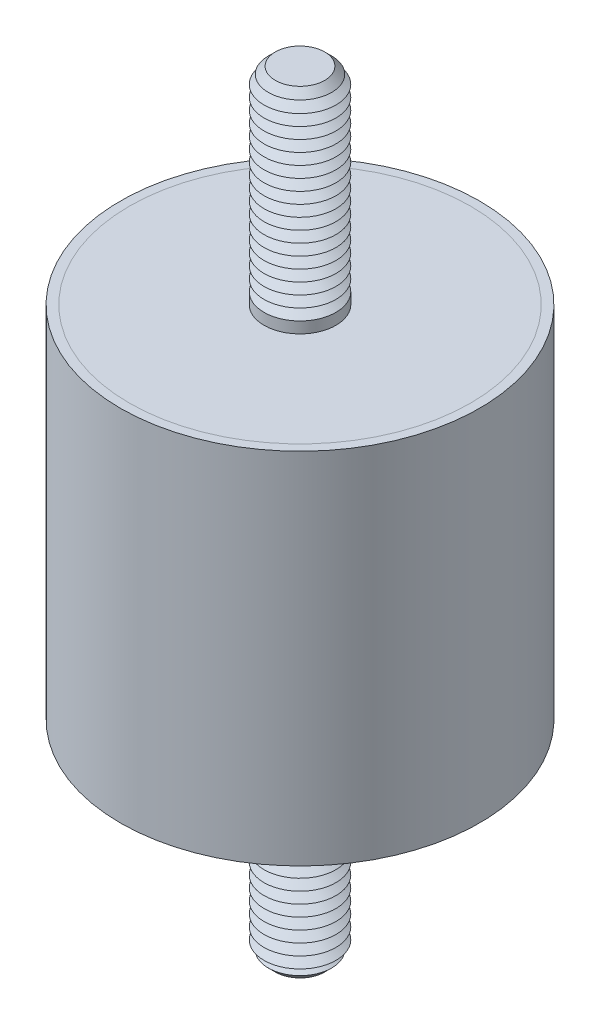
ISO-10303-21;
HEADER;
FILE_DESCRIPTION(('STEP AP214'),'2;1');
FILE_NAME('part.step','',(''),(''),'','','');
FILE_SCHEMA(('AUTOMOTIVE_DESIGN { 1 0 10303 214 1 1 1 1 }'));
ENDSEC;
DATA;
#1=APPLICATION_CONTEXT('core data for automotive mechanical design processes');
#2=APPLICATION_PROTOCOL_DEFINITION('international standard','automotive_design',2000,#1);
#3=PRODUCT_CONTEXT('',#1,'mechanical');
#4=PRODUCT('Part','Part','',(#3));
#5=PRODUCT_RELATED_PRODUCT_CATEGORY('part','',(#4));
#6=PRODUCT_DEFINITION_FORMATION('','',#4);
#7=PRODUCT_DEFINITION_CONTEXT('part definition',#1,'design');
#8=PRODUCT_DEFINITION('design','',#6,#7);
#9=PRODUCT_DEFINITION_SHAPE('','',#8);
#10=(LENGTH_UNIT() NAMED_UNIT(*) SI_UNIT(.MILLI.,.METRE.));
#11=(NAMED_UNIT(*) PLANE_ANGLE_UNIT() SI_UNIT($,.RADIAN.));
#12=(NAMED_UNIT(*) SI_UNIT($,.STERADIAN.) SOLID_ANGLE_UNIT());
#13=UNCERTAINTY_MEASURE_WITH_UNIT(LENGTH_MEASURE(1.E-05),#10,'distance_accuracy_value','');
#14=(GEOMETRIC_REPRESENTATION_CONTEXT(3) GLOBAL_UNCERTAINTY_ASSIGNED_CONTEXT((#13)) GLOBAL_UNIT_ASSIGNED_CONTEXT((#10,
#11,#12)) REPRESENTATION_CONTEXT('',''));
#15=CARTESIAN_POINT('',(0.,0.,0.));
#16=DIRECTION('',(0.,0.,1.));
#17=DIRECTION('',(1.,0.,0.));
#18=AXIS2_PLACEMENT_3D('',#15,#16,#17);
#19=CARTESIAN_POINT('',(0.,-43.,0.));
#20=DIRECTION('',(0.,1.,0.));
#21=DIRECTION('',(0.,0.,1.));
#22=AXIS2_PLACEMENT_3D('',#19,#20,#21);
#23=CYLINDRICAL_SURFACE('',#22,4.);
#24=CARTESIAN_POINT('',(0.,-20.,0.));
#25=DIRECTION('',(0.,-1.,0.));
#26=DIRECTION('',(0.,0.,-1.));
#27=AXIS2_PLACEMENT_3D('',#24,#25,#26);
#28=CIRCLE('',#27,4.);
#29=CARTESIAN_POINT('',(0.,-20.,-4.));
#30=VERTEX_POINT('',#29);
#31=EDGE_CURVE('P0_E22',#30,#30,#28,.T.);
#32=ORIENTED_EDGE('',*,*,#31,.T.);
#33=EDGE_LOOP('',(#32));
#34=FACE_BOUND('',#33,.T.);
#35=CARTESIAN_POINT('',(0.,-21.25,0.));
#36=DIRECTION('',(0.,1.,0.));
#37=DIRECTION('',(0.,0.,1.));
#38=AXIS2_PLACEMENT_3D('',#35,#36,#37);
#39=CIRCLE('',#38,4.);
#40=CARTESIAN_POINT('',(0.,-21.25,4.));
#41=VERTEX_POINT('',#40);
#42=EDGE_CURVE('P0_E32',#41,#41,#39,.T.);
#43=ORIENTED_EDGE('',*,*,#42,.T.);
#44=EDGE_LOOP('',(#43));
#45=FACE_BOUND('',#44,.T.);
#46=ADVANCED_FACE('P0_F14',(#34,#45),#23,.T.);
#47=CARTESIAN_POINT('',(0.,-20.,0.));
#48=DIRECTION('',(0.,1.,0.));
#49=DIRECTION('',(0.,0.,1.));
#50=AXIS2_PLACEMENT_3D('',#47,#48,#49);
#51=CYLINDRICAL_SURFACE('',#50,19.);
#52=CARTESIAN_POINT('',(0.,-20.,0.));
#53=DIRECTION('',(0.,1.,0.));
#54=DIRECTION('',(0.,0.,1.));
#55=AXIS2_PLACEMENT_3D('',#52,#53,#54);
#56=CIRCLE('',#55,19.);
#57=CARTESIAN_POINT('',(0.,-20.,19.));
#58=VERTEX_POINT('',#57);
#59=EDGE_CURVE('P0_E26',#58,#58,#56,.T.);
#60=ORIENTED_EDGE('',*,*,#59,.T.);
#61=EDGE_LOOP('',(#60));
#62=FACE_BOUND('',#61,.T.);
#63=CARTESIAN_POINT('',(0.,-18.5,0.));
#64=DIRECTION('',(0.,1.,0.));
#65=DIRECTION('',(0.,0.,1.));
#66=AXIS2_PLACEMENT_3D('',#63,#64,#65);
#67=CIRCLE('',#66,19.);
#68=CARTESIAN_POINT('',(0.,-18.5,19.));
#69=VERTEX_POINT('',#68);
#70=EDGE_CURVE('P0_E29',#69,#69,#67,.T.);
#71=ORIENTED_EDGE('',*,*,#70,.F.);
#72=EDGE_LOOP('',(#71));
#73=FACE_BOUND('',#72,.T.);
#74=ADVANCED_FACE('P0_F155',(#62,#73),#51,.T.);
#75=CARTESIAN_POINT('',(0.,-20.,0.));
#76=DIRECTION('',(0.,1.,0.));
#77=DIRECTION('',(0.,0.,1.));
#78=AXIS2_PLACEMENT_3D('',#75,#76,#77);
#79=PLANE('',#78);
#80=ORIENTED_EDGE('',*,*,#31,.F.);
#81=EDGE_LOOP('',(#80));
#82=FACE_BOUND('',#81,.T.);
#83=ORIENTED_EDGE('',*,*,#59,.F.);
#84=EDGE_LOOP('',(#83));
#85=FACE_BOUND('',#84,.T.);
#86=ADVANCED_FACE('P0_F161',(#82,#85),#79,.F.);
#87=CARTESIAN_POINT('',(0.,-18.5,0.));
#88=DIRECTION('',(0.,1.,0.));
#89=DIRECTION('',(0.,0.,1.));
#90=AXIS2_PLACEMENT_3D('',#87,#88,#89);
#91=PLANE('',#90);
#92=ORIENTED_EDGE('',*,*,#70,.T.);
#93=EDGE_LOOP('',(#92));
#94=FACE_BOUND('',#93,.T.);
#95=ADVANCED_FACE('P0_F168',(#94),#91,.T.);
#96=CARTESIAN_POINT('',(0.,-21.25,0.));
#97=DIRECTION('',(0.,1.,0.));
#98=DIRECTION('',(0.,0.,1.));
#99=AXIS2_PLACEMENT_3D('',#96,#97,#98);
#100=CONICAL_SURFACE('',#99,4.,1.0471975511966);
#101=CARTESIAN_POINT('',(0.,-21.875,0.));
#102=DIRECTION('',(0.,1.,0.));
#103=DIRECTION('',(0.,0.,1.));
#104=AXIS2_PLACEMENT_3D('',#101,#102,#103);
#105=CIRCLE('',#104,2.91746824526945);
#106=CARTESIAN_POINT('',(0.,-21.875,2.91746824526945));
#107=VERTEX_POINT('',#106);
#108=EDGE_CURVE('P0_E37',#107,#107,#105,.T.);
#109=ORIENTED_EDGE('',*,*,#108,.T.);
#110=EDGE_LOOP('',(#109));
#111=FACE_BOUND('',#110,.T.);
#112=ORIENTED_EDGE('',*,*,#42,.F.);
#113=EDGE_LOOP('',(#112));
#114=FACE_BOUND('',#113,.T.);
#115=ADVANCED_FACE('P0_F171',(#111,#114),#100,.T.);
#116=CARTESIAN_POINT('',(0.,-21.875,0.));
#117=DIRECTION('',(0.,-1.,0.));
#118=DIRECTION('',(0.,0.,-1.));
#119=AXIS2_PLACEMENT_3D('',#116,#117,#118);
#120=CONICAL_SURFACE('',#119,2.91746824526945,1.0471975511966);
#121=CARTESIAN_POINT('',(0.,-22.5,0.));
#122=DIRECTION('',(0.,1.,0.));
#123=DIRECTION('',(0.,0.,1.));
#124=AXIS2_PLACEMENT_3D('',#121,#122,#123);
#125=CIRCLE('',#124,4.);
#126=CARTESIAN_POINT('',(0.,-22.5,4.));
#127=VERTEX_POINT('',#126);
#128=EDGE_CURVE('P0_E40',#127,#127,#125,.T.);
#129=ORIENTED_EDGE('',*,*,#128,.T.);
#130=EDGE_LOOP('',(#129));
#131=FACE_BOUND('',#130,.T.);
#132=ORIENTED_EDGE('',*,*,#108,.F.);
#133=EDGE_LOOP('',(#132));
#134=FACE_BOUND('',#133,.T.);
#135=ADVANCED_FACE('P0_F176',(#131,#134),#120,.T.);
#136=CARTESIAN_POINT('',(0.,-22.5,0.));
#137=DIRECTION('',(0.,1.,0.));
#138=DIRECTION('',(0.,0.,1.));
#139=AXIS2_PLACEMENT_3D('',#136,#137,#138);
#140=CONICAL_SURFACE('',#139,4.,1.0471975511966);
#141=CARTESIAN_POINT('',(0.,-23.125,0.));
#142=DIRECTION('',(0.,1.,0.));
#143=DIRECTION('',(0.,0.,1.));
#144=AXIS2_PLACEMENT_3D('',#141,#142,#143);
#145=CIRCLE('',#144,2.91746824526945);
#146=CARTESIAN_POINT('',(0.,-23.125,2.91746824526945));
#147=VERTEX_POINT('',#146);
#148=EDGE_CURVE('P0_E43',#147,#147,#145,.T.);
#149=ORIENTED_EDGE('',*,*,#148,.T.);
#150=EDGE_LOOP('',(#149));
#151=FACE_BOUND('',#150,.T.);
#152=ORIENTED_EDGE('',*,*,#128,.F.);
#153=EDGE_LOOP('',(#152));
#154=FACE_BOUND('',#153,.T.);
#155=ADVANCED_FACE('P0_F183',(#151,#154),#140,.T.);
#156=CARTESIAN_POINT('',(0.,-23.125,0.));
#157=DIRECTION('',(0.,-1.,0.));
#158=DIRECTION('',(0.,0.,-1.));
#159=AXIS2_PLACEMENT_3D('',#156,#157,#158);
#160=CONICAL_SURFACE('',#159,2.91746824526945,1.0471975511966);
#161=CARTESIAN_POINT('',(0.,-23.75,0.));
#162=DIRECTION('',(0.,1.,0.));
#163=DIRECTION('',(0.,0.,1.));
#164=AXIS2_PLACEMENT_3D('',#161,#162,#163);
#165=CIRCLE('',#164,4.);
#166=CARTESIAN_POINT('',(0.,-23.75,4.));
#167=VERTEX_POINT('',#166);
#168=EDGE_CURVE('P0_E46',#167,#167,#165,.T.);
#169=ORIENTED_EDGE('',*,*,#168,.T.);
#170=EDGE_LOOP('',(#169));
#171=FACE_BOUND('',#170,.T.);
#172=ORIENTED_EDGE('',*,*,#148,.F.);
#173=EDGE_LOOP('',(#172));
#174=FACE_BOUND('',#173,.T.);
#175=ADVANCED_FACE('P0_F190',(#171,#174),#160,.T.);
#176=CARTESIAN_POINT('',(0.,-23.75,0.));
#177=DIRECTION('',(0.,1.,0.));
#178=DIRECTION('',(0.,0.,1.));
#179=AXIS2_PLACEMENT_3D('',#176,#177,#178);
#180=CONICAL_SURFACE('',#179,4.,1.0471975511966);
#181=CARTESIAN_POINT('',(0.,-24.375,0.));
#182=DIRECTION('',(0.,1.,0.));
#183=DIRECTION('',(0.,0.,1.));
#184=AXIS2_PLACEMENT_3D('',#181,#182,#183);
#185=CIRCLE('',#184,2.91746824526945);
#186=CARTESIAN_POINT('',(0.,-24.375,2.91746824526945));
#187=VERTEX_POINT('',#186);
#188=EDGE_CURVE('P0_E49',#187,#187,#185,.T.);
#189=ORIENTED_EDGE('',*,*,#188,.T.);
#190=EDGE_LOOP('',(#189));
#191=FACE_BOUND('',#190,.T.);
#192=ORIENTED_EDGE('',*,*,#168,.F.);
#193=EDGE_LOOP('',(#192));
#194=FACE_BOUND('',#193,.T.);
#195=ADVANCED_FACE('P0_F194',(#191,#194),#180,.T.);
#196=CARTESIAN_POINT('',(0.,-24.375,0.));
#197=DIRECTION('',(0.,-1.,0.));
#198=DIRECTION('',(0.,0.,-1.));
#199=AXIS2_PLACEMENT_3D('',#196,#197,#198);
#200=CONICAL_SURFACE('',#199,2.91746824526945,1.0471975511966);
#201=CARTESIAN_POINT('',(0.,-25.,0.));
#202=DIRECTION('',(0.,1.,0.));
#203=DIRECTION('',(0.,0.,1.));
#204=AXIS2_PLACEMENT_3D('',#201,#202,#203);
#205=CIRCLE('',#204,4.);
#206=CARTESIAN_POINT('',(0.,-25.,4.));
#207=VERTEX_POINT('',#206);
#208=EDGE_CURVE('P0_E52',#207,#207,#205,.T.);
#209=ORIENTED_EDGE('',*,*,#208,.T.);
#210=EDGE_LOOP('',(#209));
#211=FACE_BOUND('',#210,.T.);
#212=ORIENTED_EDGE('',*,*,#188,.F.);
#213=EDGE_LOOP('',(#212));
#214=FACE_BOUND('',#213,.T.);
#215=ADVANCED_FACE('P0_F198',(#211,#214),#200,.T.);
#216=CARTESIAN_POINT('',(0.,-25.,0.));
#217=DIRECTION('',(0.,1.,0.));
#218=DIRECTION('',(0.,0.,1.));
#219=AXIS2_PLACEMENT_3D('',#216,#217,#218);
#220=CONICAL_SURFACE('',#219,4.,1.0471975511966);
#221=CARTESIAN_POINT('',(0.,-25.625,0.));
#222=DIRECTION('',(0.,1.,0.));
#223=DIRECTION('',(0.,0.,1.));
#224=AXIS2_PLACEMENT_3D('',#221,#222,#223);
#225=CIRCLE('',#224,2.91746824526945);
#226=CARTESIAN_POINT('',(0.,-25.625,2.91746824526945));
#227=VERTEX_POINT('',#226);
#228=EDGE_CURVE('P0_E55',#227,#227,#225,.T.);
#229=ORIENTED_EDGE('',*,*,#228,.T.);
#230=EDGE_LOOP('',(#229));
#231=FACE_BOUND('',#230,.T.);
#232=ORIENTED_EDGE('',*,*,#208,.F.);
#233=EDGE_LOOP('',(#232));
#234=FACE_BOUND('',#233,.T.);
#235=ADVANCED_FACE('P0_F202',(#231,#234),#220,.T.);
#236=CARTESIAN_POINT('',(0.,-25.625,0.));
#237=DIRECTION('',(0.,-1.,0.));
#238=DIRECTION('',(0.,0.,-1.));
#239=AXIS2_PLACEMENT_3D('',#236,#237,#238);
#240=CONICAL_SURFACE('',#239,2.91746824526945,1.0471975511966);
#241=CARTESIAN_POINT('',(0.,-26.25,0.));
#242=DIRECTION('',(0.,1.,0.));
#243=DIRECTION('',(0.,0.,1.));
#244=AXIS2_PLACEMENT_3D('',#241,#242,#243);
#245=CIRCLE('',#244,4.);
#246=CARTESIAN_POINT('',(0.,-26.25,4.));
#247=VERTEX_POINT('',#246);
#248=EDGE_CURVE('P0_E58',#247,#247,#245,.T.);
#249=ORIENTED_EDGE('',*,*,#248,.T.);
#250=EDGE_LOOP('',(#249));
#251=FACE_BOUND('',#250,.T.);
#252=ORIENTED_EDGE('',*,*,#228,.F.);
#253=EDGE_LOOP('',(#252));
#254=FACE_BOUND('',#253,.T.);
#255=ADVANCED_FACE('P0_F206',(#251,#254),#240,.T.);
#256=CARTESIAN_POINT('',(0.,-26.25,0.));
#257=DIRECTION('',(0.,1.,0.));
#258=DIRECTION('',(0.,0.,1.));
#259=AXIS2_PLACEMENT_3D('',#256,#257,#258);
#260=CONICAL_SURFACE('',#259,4.,1.0471975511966);
#261=CARTESIAN_POINT('',(0.,-26.875,0.));
#262=DIRECTION('',(0.,1.,0.));
#263=DIRECTION('',(0.,0.,1.));
#264=AXIS2_PLACEMENT_3D('',#261,#262,#263);
#265=CIRCLE('',#264,2.91746824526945);
#266=CARTESIAN_POINT('',(0.,-26.875,2.91746824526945));
#267=VERTEX_POINT('',#266);
#268=EDGE_CURVE('P0_E61',#267,#267,#265,.T.);
#269=ORIENTED_EDGE('',*,*,#268,.T.);
#270=EDGE_LOOP('',(#269));
#271=FACE_BOUND('',#270,.T.);
#272=ORIENTED_EDGE('',*,*,#248,.F.);
#273=EDGE_LOOP('',(#272));
#274=FACE_BOUND('',#273,.T.);
#275=ADVANCED_FACE('P0_F210',(#271,#274),#260,.T.);
#276=CARTESIAN_POINT('',(0.,-26.875,0.));
#277=DIRECTION('',(0.,-1.,0.));
#278=DIRECTION('',(0.,0.,-1.));
#279=AXIS2_PLACEMENT_3D('',#276,#277,#278);
#280=CONICAL_SURFACE('',#279,2.91746824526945,1.0471975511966);
#281=CARTESIAN_POINT('',(0.,-27.5,0.));
#282=DIRECTION('',(0.,1.,0.));
#283=DIRECTION('',(0.,0.,1.));
#284=AXIS2_PLACEMENT_3D('',#281,#282,#283);
#285=CIRCLE('',#284,4.);
#286=CARTESIAN_POINT('',(0.,-27.5,4.));
#287=VERTEX_POINT('',#286);
#288=EDGE_CURVE('P0_E64',#287,#287,#285,.T.);
#289=ORIENTED_EDGE('',*,*,#288,.T.);
#290=EDGE_LOOP('',(#289));
#291=FACE_BOUND('',#290,.T.);
#292=ORIENTED_EDGE('',*,*,#268,.F.);
#293=EDGE_LOOP('',(#292));
#294=FACE_BOUND('',#293,.T.);
#295=ADVANCED_FACE('P0_F214',(#291,#294),#280,.T.);
#296=CARTESIAN_POINT('',(0.,-27.5,0.));
#297=DIRECTION('',(0.,1.,0.));
#298=DIRECTION('',(0.,0.,1.));
#299=AXIS2_PLACEMENT_3D('',#296,#297,#298);
#300=CONICAL_SURFACE('',#299,4.,1.0471975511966);
#301=CARTESIAN_POINT('',(0.,-28.125,0.));
#302=DIRECTION('',(0.,1.,0.));
#303=DIRECTION('',(0.,0.,1.));
#304=AXIS2_PLACEMENT_3D('',#301,#302,#303);
#305=CIRCLE('',#304,2.91746824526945);
#306=CARTESIAN_POINT('',(0.,-28.125,2.91746824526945));
#307=VERTEX_POINT('',#306);
#308=EDGE_CURVE('P0_E67',#307,#307,#305,.T.);
#309=ORIENTED_EDGE('',*,*,#308,.T.);
#310=EDGE_LOOP('',(#309));
#311=FACE_BOUND('',#310,.T.);
#312=ORIENTED_EDGE('',*,*,#288,.F.);
#313=EDGE_LOOP('',(#312));
#314=FACE_BOUND('',#313,.T.);
#315=ADVANCED_FACE('P0_F218',(#311,#314),#300,.T.);
#316=CARTESIAN_POINT('',(0.,-28.125,0.));
#317=DIRECTION('',(0.,-1.,0.));
#318=DIRECTION('',(0.,0.,-1.));
#319=AXIS2_PLACEMENT_3D('',#316,#317,#318);
#320=CONICAL_SURFACE('',#319,2.91746824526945,1.0471975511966);
#321=CARTESIAN_POINT('',(0.,-28.75,0.));
#322=DIRECTION('',(0.,1.,0.));
#323=DIRECTION('',(0.,0.,1.));
#324=AXIS2_PLACEMENT_3D('',#321,#322,#323);
#325=CIRCLE('',#324,4.);
#326=CARTESIAN_POINT('',(0.,-28.75,4.));
#327=VERTEX_POINT('',#326);
#328=EDGE_CURVE('P0_E70',#327,#327,#325,.T.);
#329=ORIENTED_EDGE('',*,*,#328,.T.);
#330=EDGE_LOOP('',(#329));
#331=FACE_BOUND('',#330,.T.);
#332=ORIENTED_EDGE('',*,*,#308,.F.);
#333=EDGE_LOOP('',(#332));
#334=FACE_BOUND('',#333,.T.);
#335=ADVANCED_FACE('P0_F222',(#331,#334),#320,.T.);
#336=CARTESIAN_POINT('',(0.,-28.75,0.));
#337=DIRECTION('',(0.,1.,0.));
#338=DIRECTION('',(0.,0.,1.));
#339=AXIS2_PLACEMENT_3D('',#336,#337,#338);
#340=CONICAL_SURFACE('',#339,4.,1.0471975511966);
#341=CARTESIAN_POINT('',(0.,-29.375,0.));
#342=DIRECTION('',(0.,1.,0.));
#343=DIRECTION('',(0.,0.,1.));
#344=AXIS2_PLACEMENT_3D('',#341,#342,#343);
#345=CIRCLE('',#344,2.91746824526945);
#346=CARTESIAN_POINT('',(0.,-29.375,2.91746824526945));
#347=VERTEX_POINT('',#346);
#348=EDGE_CURVE('P0_E73',#347,#347,#345,.T.);
#349=ORIENTED_EDGE('',*,*,#348,.T.);
#350=EDGE_LOOP('',(#349));
#351=FACE_BOUND('',#350,.T.);
#352=ORIENTED_EDGE('',*,*,#328,.F.);
#353=EDGE_LOOP('',(#352));
#354=FACE_BOUND('',#353,.T.);
#355=ADVANCED_FACE('P0_F226',(#351,#354),#340,.T.);
#356=CARTESIAN_POINT('',(0.,-29.375,0.));
#357=DIRECTION('',(0.,-1.,0.));
#358=DIRECTION('',(0.,0.,-1.));
#359=AXIS2_PLACEMENT_3D('',#356,#357,#358);
#360=CONICAL_SURFACE('',#359,2.91746824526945,1.0471975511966);
#361=CARTESIAN_POINT('',(0.,-30.,0.));
#362=DIRECTION('',(0.,1.,0.));
#363=DIRECTION('',(0.,0.,1.));
#364=AXIS2_PLACEMENT_3D('',#361,#362,#363);
#365=CIRCLE('',#364,4.);
#366=CARTESIAN_POINT('',(0.,-30.,4.));
#367=VERTEX_POINT('',#366);
#368=EDGE_CURVE('P0_E76',#367,#367,#365,.T.);
#369=ORIENTED_EDGE('',*,*,#368,.T.);
#370=EDGE_LOOP('',(#369));
#371=FACE_BOUND('',#370,.T.);
#372=ORIENTED_EDGE('',*,*,#348,.F.);
#373=EDGE_LOOP('',(#372));
#374=FACE_BOUND('',#373,.T.);
#375=ADVANCED_FACE('P0_F230',(#371,#374),#360,.T.);
#376=CARTESIAN_POINT('',(0.,-30.,0.));
#377=DIRECTION('',(0.,1.,0.));
#378=DIRECTION('',(0.,0.,1.));
#379=AXIS2_PLACEMENT_3D('',#376,#377,#378);
#380=CONICAL_SURFACE('',#379,4.,1.0471975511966);
#381=CARTESIAN_POINT('',(0.,-30.625,0.));
#382=DIRECTION('',(0.,1.,0.));
#383=DIRECTION('',(0.,0.,1.));
#384=AXIS2_PLACEMENT_3D('',#381,#382,#383);
#385=CIRCLE('',#384,2.91746824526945);
#386=CARTESIAN_POINT('',(0.,-30.625,2.91746824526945));
#387=VERTEX_POINT('',#386);
#388=EDGE_CURVE('P0_E79',#387,#387,#385,.T.);
#389=ORIENTED_EDGE('',*,*,#388,.T.);
#390=EDGE_LOOP('',(#389));
#391=FACE_BOUND('',#390,.T.);
#392=ORIENTED_EDGE('',*,*,#368,.F.);
#393=EDGE_LOOP('',(#392));
#394=FACE_BOUND('',#393,.T.);
#395=ADVANCED_FACE('P0_F234',(#391,#394),#380,.T.);
#396=CARTESIAN_POINT('',(0.,-30.625,0.));
#397=DIRECTION('',(0.,-1.,0.));
#398=DIRECTION('',(0.,0.,-1.));
#399=AXIS2_PLACEMENT_3D('',#396,#397,#398);
#400=CONICAL_SURFACE('',#399,2.91746824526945,1.0471975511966);
#401=CARTESIAN_POINT('',(0.,-31.25,0.));
#402=DIRECTION('',(0.,1.,0.));
#403=DIRECTION('',(0.,0.,1.));
#404=AXIS2_PLACEMENT_3D('',#401,#402,#403);
#405=CIRCLE('',#404,4.);
#406=CARTESIAN_POINT('',(0.,-31.25,4.));
#407=VERTEX_POINT('',#406);
#408=EDGE_CURVE('P0_E82',#407,#407,#405,.T.);
#409=ORIENTED_EDGE('',*,*,#408,.T.);
#410=EDGE_LOOP('',(#409));
#411=FACE_BOUND('',#410,.T.);
#412=ORIENTED_EDGE('',*,*,#388,.F.);
#413=EDGE_LOOP('',(#412));
#414=FACE_BOUND('',#413,.T.);
#415=ADVANCED_FACE('P0_F238',(#411,#414),#400,.T.);
#416=CARTESIAN_POINT('',(0.,-31.25,0.));
#417=DIRECTION('',(0.,1.,0.));
#418=DIRECTION('',(0.,0.,1.));
#419=AXIS2_PLACEMENT_3D('',#416,#417,#418);
#420=CONICAL_SURFACE('',#419,4.,1.0471975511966);
#421=CARTESIAN_POINT('',(0.,-31.875,0.));
#422=DIRECTION('',(0.,1.,0.));
#423=DIRECTION('',(0.,0.,1.));
#424=AXIS2_PLACEMENT_3D('',#421,#422,#423);
#425=CIRCLE('',#424,2.91746824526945);
#426=CARTESIAN_POINT('',(0.,-31.875,2.91746824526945));
#427=VERTEX_POINT('',#426);
#428=EDGE_CURVE('P0_E85',#427,#427,#425,.T.);
#429=ORIENTED_EDGE('',*,*,#428,.T.);
#430=EDGE_LOOP('',(#429));
#431=FACE_BOUND('',#430,.T.);
#432=ORIENTED_EDGE('',*,*,#408,.F.);
#433=EDGE_LOOP('',(#432));
#434=FACE_BOUND('',#433,.T.);
#435=ADVANCED_FACE('P0_F242',(#431,#434),#420,.T.);
#436=CARTESIAN_POINT('',(0.,-31.875,0.));
#437=DIRECTION('',(0.,-1.,0.));
#438=DIRECTION('',(0.,0.,-1.));
#439=AXIS2_PLACEMENT_3D('',#436,#437,#438);
#440=CONICAL_SURFACE('',#439,2.91746824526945,1.0471975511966);
#441=CARTESIAN_POINT('',(0.,-32.5,0.));
#442=DIRECTION('',(0.,1.,0.));
#443=DIRECTION('',(0.,0.,1.));
#444=AXIS2_PLACEMENT_3D('',#441,#442,#443);
#445=CIRCLE('',#444,4.);
#446=CARTESIAN_POINT('',(0.,-32.5,4.));
#447=VERTEX_POINT('',#446);
#448=EDGE_CURVE('P0_E88',#447,#447,#445,.T.);
#449=ORIENTED_EDGE('',*,*,#448,.T.);
#450=EDGE_LOOP('',(#449));
#451=FACE_BOUND('',#450,.T.);
#452=ORIENTED_EDGE('',*,*,#428,.F.);
#453=EDGE_LOOP('',(#452));
#454=FACE_BOUND('',#453,.T.);
#455=ADVANCED_FACE('P0_F246',(#451,#454),#440,.T.);
#456=CARTESIAN_POINT('',(0.,-32.5,0.));
#457=DIRECTION('',(0.,1.,0.));
#458=DIRECTION('',(0.,0.,1.));
#459=AXIS2_PLACEMENT_3D('',#456,#457,#458);
#460=CONICAL_SURFACE('',#459,4.,1.0471975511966);
#461=CARTESIAN_POINT('',(0.,-33.125,0.));
#462=DIRECTION('',(0.,1.,0.));
#463=DIRECTION('',(0.,0.,1.));
#464=AXIS2_PLACEMENT_3D('',#461,#462,#463);
#465=CIRCLE('',#464,2.91746824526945);
#466=CARTESIAN_POINT('',(0.,-33.125,2.91746824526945));
#467=VERTEX_POINT('',#466);
#468=EDGE_CURVE('P0_E91',#467,#467,#465,.T.);
#469=ORIENTED_EDGE('',*,*,#468,.T.);
#470=EDGE_LOOP('',(#469));
#471=FACE_BOUND('',#470,.T.);
#472=ORIENTED_EDGE('',*,*,#448,.F.);
#473=EDGE_LOOP('',(#472));
#474=FACE_BOUND('',#473,.T.);
#475=ADVANCED_FACE('P0_F250',(#471,#474),#460,.T.);
#476=CARTESIAN_POINT('',(0.,-33.125,0.));
#477=DIRECTION('',(0.,-1.,0.));
#478=DIRECTION('',(0.,0.,-1.));
#479=AXIS2_PLACEMENT_3D('',#476,#477,#478);
#480=CONICAL_SURFACE('',#479,2.91746824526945,1.0471975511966);
#481=CARTESIAN_POINT('',(0.,-33.75,0.));
#482=DIRECTION('',(0.,1.,0.));
#483=DIRECTION('',(0.,0.,1.));
#484=AXIS2_PLACEMENT_3D('',#481,#482,#483);
#485=CIRCLE('',#484,4.);
#486=CARTESIAN_POINT('',(0.,-33.75,4.));
#487=VERTEX_POINT('',#486);
#488=EDGE_CURVE('P0_E94',#487,#487,#485,.T.);
#489=ORIENTED_EDGE('',*,*,#488,.T.);
#490=EDGE_LOOP('',(#489));
#491=FACE_BOUND('',#490,.T.);
#492=ORIENTED_EDGE('',*,*,#468,.F.);
#493=EDGE_LOOP('',(#492));
#494=FACE_BOUND('',#493,.T.);
#495=ADVANCED_FACE('P0_F254',(#491,#494),#480,.T.);
#496=CARTESIAN_POINT('',(0.,-33.75,0.));
#497=DIRECTION('',(0.,1.,0.));
#498=DIRECTION('',(0.,0.,1.));
#499=AXIS2_PLACEMENT_3D('',#496,#497,#498);
#500=CONICAL_SURFACE('',#499,4.,1.0471975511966);
#501=CARTESIAN_POINT('',(0.,-34.375,0.));
#502=DIRECTION('',(0.,1.,0.));
#503=DIRECTION('',(0.,0.,1.));
#504=AXIS2_PLACEMENT_3D('',#501,#502,#503);
#505=CIRCLE('',#504,2.91746824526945);
#506=CARTESIAN_POINT('',(0.,-34.375,2.91746824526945));
#507=VERTEX_POINT('',#506);
#508=EDGE_CURVE('P0_E97',#507,#507,#505,.T.);
#509=ORIENTED_EDGE('',*,*,#508,.T.);
#510=EDGE_LOOP('',(#509));
#511=FACE_BOUND('',#510,.T.);
#512=ORIENTED_EDGE('',*,*,#488,.F.);
#513=EDGE_LOOP('',(#512));
#514=FACE_BOUND('',#513,.T.);
#515=ADVANCED_FACE('P0_F258',(#511,#514),#500,.T.);
#516=CARTESIAN_POINT('',(0.,-34.375,0.));
#517=DIRECTION('',(0.,-1.,0.));
#518=DIRECTION('',(0.,0.,-1.));
#519=AXIS2_PLACEMENT_3D('',#516,#517,#518);
#520=CONICAL_SURFACE('',#519,2.91746824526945,1.0471975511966);
#521=CARTESIAN_POINT('',(0.,-35.,0.));
#522=DIRECTION('',(0.,1.,0.));
#523=DIRECTION('',(0.,0.,1.));
#524=AXIS2_PLACEMENT_3D('',#521,#522,#523);
#525=CIRCLE('',#524,4.);
#526=CARTESIAN_POINT('',(0.,-35.,4.));
#527=VERTEX_POINT('',#526);
#528=EDGE_CURVE('P0_E100',#527,#527,#525,.T.);
#529=ORIENTED_EDGE('',*,*,#528,.T.);
#530=EDGE_LOOP('',(#529));
#531=FACE_BOUND('',#530,.T.);
#532=ORIENTED_EDGE('',*,*,#508,.F.);
#533=EDGE_LOOP('',(#532));
#534=FACE_BOUND('',#533,.T.);
#535=ADVANCED_FACE('P0_F262',(#531,#534),#520,.T.);
#536=CARTESIAN_POINT('',(0.,-35.,0.));
#537=DIRECTION('',(0.,1.,0.));
#538=DIRECTION('',(0.,0.,1.));
#539=AXIS2_PLACEMENT_3D('',#536,#537,#538);
#540=CONICAL_SURFACE('',#539,4.,1.0471975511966);
#541=CARTESIAN_POINT('',(0.,-35.625,0.));
#542=DIRECTION('',(0.,1.,0.));
#543=DIRECTION('',(0.,0.,1.));
#544=AXIS2_PLACEMENT_3D('',#541,#542,#543);
#545=CIRCLE('',#544,2.91746824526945);
#546=CARTESIAN_POINT('',(0.,-35.625,2.91746824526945));
#547=VERTEX_POINT('',#546);
#548=EDGE_CURVE('P0_E103',#547,#547,#545,.T.);
#549=ORIENTED_EDGE('',*,*,#548,.T.);
#550=EDGE_LOOP('',(#549));
#551=FACE_BOUND('',#550,.T.);
#552=ORIENTED_EDGE('',*,*,#528,.F.);
#553=EDGE_LOOP('',(#552));
#554=FACE_BOUND('',#553,.T.);
#555=ADVANCED_FACE('P0_F266',(#551,#554),#540,.T.);
#556=CARTESIAN_POINT('',(0.,-35.625,0.));
#557=DIRECTION('',(0.,-1.,0.));
#558=DIRECTION('',(0.,0.,-1.));
#559=AXIS2_PLACEMENT_3D('',#556,#557,#558);
#560=CONICAL_SURFACE('',#559,2.91746824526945,1.0471975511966);
#561=CARTESIAN_POINT('',(0.,-36.25,0.));
#562=DIRECTION('',(0.,1.,0.));
#563=DIRECTION('',(0.,0.,1.));
#564=AXIS2_PLACEMENT_3D('',#561,#562,#563);
#565=CIRCLE('',#564,4.);
#566=CARTESIAN_POINT('',(0.,-36.25,4.));
#567=VERTEX_POINT('',#566);
#568=EDGE_CURVE('P0_E106',#567,#567,#565,.T.);
#569=ORIENTED_EDGE('',*,*,#568,.T.);
#570=EDGE_LOOP('',(#569));
#571=FACE_BOUND('',#570,.T.);
#572=ORIENTED_EDGE('',*,*,#548,.F.);
#573=EDGE_LOOP('',(#572));
#574=FACE_BOUND('',#573,.T.);
#575=ADVANCED_FACE('P0_F270',(#571,#574),#560,.T.);
#576=CARTESIAN_POINT('',(0.,-36.25,0.));
#577=DIRECTION('',(0.,1.,0.));
#578=DIRECTION('',(0.,0.,1.));
#579=AXIS2_PLACEMENT_3D('',#576,#577,#578);
#580=CONICAL_SURFACE('',#579,4.,1.0471975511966);
#581=CARTESIAN_POINT('',(0.,-36.875,0.));
#582=DIRECTION('',(0.,1.,0.));
#583=DIRECTION('',(0.,0.,1.));
#584=AXIS2_PLACEMENT_3D('',#581,#582,#583);
#585=CIRCLE('',#584,2.91746824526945);
#586=CARTESIAN_POINT('',(0.,-36.875,2.91746824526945));
#587=VERTEX_POINT('',#586);
#588=EDGE_CURVE('P0_E109',#587,#587,#585,.T.);
#589=ORIENTED_EDGE('',*,*,#588,.T.);
#590=EDGE_LOOP('',(#589));
#591=FACE_BOUND('',#590,.T.);
#592=ORIENTED_EDGE('',*,*,#568,.F.);
#593=EDGE_LOOP('',(#592));
#594=FACE_BOUND('',#593,.T.);
#595=ADVANCED_FACE('P0_F274',(#591,#594),#580,.T.);
#596=CARTESIAN_POINT('',(0.,-36.875,0.));
#597=DIRECTION('',(0.,-1.,0.));
#598=DIRECTION('',(0.,0.,-1.));
#599=AXIS2_PLACEMENT_3D('',#596,#597,#598);
#600=CONICAL_SURFACE('',#599,2.91746824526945,1.0471975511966);
#601=CARTESIAN_POINT('',(0.,-37.5,0.));
#602=DIRECTION('',(0.,1.,0.));
#603=DIRECTION('',(0.,0.,1.));
#604=AXIS2_PLACEMENT_3D('',#601,#602,#603);
#605=CIRCLE('',#604,4.);
#606=CARTESIAN_POINT('',(0.,-37.5,4.));
#607=VERTEX_POINT('',#606);
#608=EDGE_CURVE('P0_E112',#607,#607,#605,.T.);
#609=ORIENTED_EDGE('',*,*,#608,.T.);
#610=EDGE_LOOP('',(#609));
#611=FACE_BOUND('',#610,.T.);
#612=ORIENTED_EDGE('',*,*,#588,.F.);
#613=EDGE_LOOP('',(#612));
#614=FACE_BOUND('',#613,.T.);
#615=ADVANCED_FACE('P0_F278',(#611,#614),#600,.T.);
#616=CARTESIAN_POINT('',(0.,-37.5,0.));
#617=DIRECTION('',(0.,1.,0.));
#618=DIRECTION('',(0.,0.,1.));
#619=AXIS2_PLACEMENT_3D('',#616,#617,#618);
#620=CONICAL_SURFACE('',#619,4.,1.0471975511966);
#621=CARTESIAN_POINT('',(0.,-38.125,0.));
#622=DIRECTION('',(0.,1.,0.));
#623=DIRECTION('',(0.,0.,1.));
#624=AXIS2_PLACEMENT_3D('',#621,#622,#623);
#625=CIRCLE('',#624,2.91746824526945);
#626=CARTESIAN_POINT('',(0.,-38.125,2.91746824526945));
#627=VERTEX_POINT('',#626);
#628=EDGE_CURVE('P0_E115',#627,#627,#625,.T.);
#629=ORIENTED_EDGE('',*,*,#628,.T.);
#630=EDGE_LOOP('',(#629));
#631=FACE_BOUND('',#630,.T.);
#632=ORIENTED_EDGE('',*,*,#608,.F.);
#633=EDGE_LOOP('',(#632));
#634=FACE_BOUND('',#633,.T.);
#635=ADVANCED_FACE('P0_F282',(#631,#634),#620,.T.);
#636=CARTESIAN_POINT('',(0.,-38.125,0.));
#637=DIRECTION('',(0.,-1.,0.));
#638=DIRECTION('',(0.,0.,-1.));
#639=AXIS2_PLACEMENT_3D('',#636,#637,#638);
#640=CONICAL_SURFACE('',#639,2.91746824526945,1.0471975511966);
#641=CARTESIAN_POINT('',(0.,-38.75,0.));
#642=DIRECTION('',(0.,1.,0.));
#643=DIRECTION('',(0.,0.,1.));
#644=AXIS2_PLACEMENT_3D('',#641,#642,#643);
#645=CIRCLE('',#644,4.);
#646=CARTESIAN_POINT('',(0.,-38.75,4.));
#647=VERTEX_POINT('',#646);
#648=EDGE_CURVE('P0_E118',#647,#647,#645,.T.);
#649=ORIENTED_EDGE('',*,*,#648,.T.);
#650=EDGE_LOOP('',(#649));
#651=FACE_BOUND('',#650,.T.);
#652=ORIENTED_EDGE('',*,*,#628,.F.);
#653=EDGE_LOOP('',(#652));
#654=FACE_BOUND('',#653,.T.);
#655=ADVANCED_FACE('P0_F286',(#651,#654),#640,.T.);
#656=CARTESIAN_POINT('',(0.,-38.75,0.));
#657=DIRECTION('',(0.,1.,0.));
#658=DIRECTION('',(0.,0.,1.));
#659=AXIS2_PLACEMENT_3D('',#656,#657,#658);
#660=CONICAL_SURFACE('',#659,4.,1.0471975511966);
#661=CARTESIAN_POINT('',(0.,-39.375,0.));
#662=DIRECTION('',(0.,1.,0.));
#663=DIRECTION('',(0.,0.,1.));
#664=AXIS2_PLACEMENT_3D('',#661,#662,#663);
#665=CIRCLE('',#664,2.91746824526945);
#666=CARTESIAN_POINT('',(0.,-39.375,2.91746824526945));
#667=VERTEX_POINT('',#666);
#668=EDGE_CURVE('P0_E121',#667,#667,#665,.T.);
#669=ORIENTED_EDGE('',*,*,#668,.T.);
#670=EDGE_LOOP('',(#669));
#671=FACE_BOUND('',#670,.T.);
#672=ORIENTED_EDGE('',*,*,#648,.F.);
#673=EDGE_LOOP('',(#672));
#674=FACE_BOUND('',#673,.T.);
#675=ADVANCED_FACE('P0_F290',(#671,#674),#660,.T.);
#676=CARTESIAN_POINT('',(0.,-39.375,0.));
#677=DIRECTION('',(0.,-1.,0.));
#678=DIRECTION('',(0.,0.,-1.));
#679=AXIS2_PLACEMENT_3D('',#676,#677,#678);
#680=CONICAL_SURFACE('',#679,2.91746824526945,1.0471975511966);
#681=CARTESIAN_POINT('',(0.,-40.,0.));
#682=DIRECTION('',(0.,1.,0.));
#683=DIRECTION('',(0.,0.,1.));
#684=AXIS2_PLACEMENT_3D('',#681,#682,#683);
#685=CIRCLE('',#684,4.);
#686=CARTESIAN_POINT('',(0.,-40.,4.));
#687=VERTEX_POINT('',#686);
#688=EDGE_CURVE('P0_E124',#687,#687,#685,.T.);
#689=ORIENTED_EDGE('',*,*,#688,.T.);
#690=EDGE_LOOP('',(#689));
#691=FACE_BOUND('',#690,.T.);
#692=ORIENTED_EDGE('',*,*,#668,.F.);
#693=EDGE_LOOP('',(#692));
#694=FACE_BOUND('',#693,.T.);
#695=ADVANCED_FACE('P0_F294',(#691,#694),#680,.T.);
#696=CARTESIAN_POINT('',(0.,-40.,0.));
#697=DIRECTION('',(0.,1.,0.));
#698=DIRECTION('',(0.,0.,1.));
#699=AXIS2_PLACEMENT_3D('',#696,#697,#698);
#700=CONICAL_SURFACE('',#699,4.,1.0471975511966);
#701=CARTESIAN_POINT('',(0.,-40.625,0.));
#702=DIRECTION('',(0.,1.,0.));
#703=DIRECTION('',(0.,0.,1.));
#704=AXIS2_PLACEMENT_3D('',#701,#702,#703);
#705=CIRCLE('',#704,2.91746824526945);
#706=CARTESIAN_POINT('',(0.,-40.625,2.91746824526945));
#707=VERTEX_POINT('',#706);
#708=EDGE_CURVE('P0_E127',#707,#707,#705,.T.);
#709=ORIENTED_EDGE('',*,*,#708,.T.);
#710=EDGE_LOOP('',(#709));
#711=FACE_BOUND('',#710,.T.);
#712=ORIENTED_EDGE('',*,*,#688,.F.);
#713=EDGE_LOOP('',(#712));
#714=FACE_BOUND('',#713,.T.);
#715=ADVANCED_FACE('P0_F298',(#711,#714),#700,.T.);
#716=CARTESIAN_POINT('',(0.,-40.625,0.));
#717=DIRECTION('',(0.,-1.,0.));
#718=DIRECTION('',(0.,0.,-1.));
#719=AXIS2_PLACEMENT_3D('',#716,#717,#718);
#720=CONICAL_SURFACE('',#719,2.91746824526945,1.0471975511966);
#721=CARTESIAN_POINT('',(0.,-41.25,0.));
#722=DIRECTION('',(0.,1.,0.));
#723=DIRECTION('',(0.,0.,1.));
#724=AXIS2_PLACEMENT_3D('',#721,#722,#723);
#725=CIRCLE('',#724,4.);
#726=CARTESIAN_POINT('',(0.,-41.25,4.));
#727=VERTEX_POINT('',#726);
#728=EDGE_CURVE('P0_E130',#727,#727,#725,.T.);
#729=ORIENTED_EDGE('',*,*,#728,.T.);
#730=EDGE_LOOP('',(#729));
#731=FACE_BOUND('',#730,.T.);
#732=ORIENTED_EDGE('',*,*,#708,.F.);
#733=EDGE_LOOP('',(#732));
#734=FACE_BOUND('',#733,.T.);
#735=ADVANCED_FACE('P0_F151',(#731,#734),#720,.T.);
#736=CARTESIAN_POINT('',(0.,-41.25,0.));
#737=DIRECTION('',(0.,1.,0.));
#738=DIRECTION('',(0.,0.,1.));
#739=AXIS2_PLACEMENT_3D('',#736,#737,#738);
#740=CONICAL_SURFACE('',#739,4.,1.0471975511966);
#741=CARTESIAN_POINT('',(0.,-41.875,0.));
#742=DIRECTION('',(0.,1.,0.));
#743=DIRECTION('',(0.,0.,1.));
#744=AXIS2_PLACEMENT_3D('',#741,#742,#743);
#745=CIRCLE('',#744,2.91746824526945);
#746=CARTESIAN_POINT('',(0.,-41.875,2.91746824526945));
#747=VERTEX_POINT('',#746);
#748=EDGE_CURVE('P0_E133',#747,#747,#745,.T.);
#749=ORIENTED_EDGE('',*,*,#748,.T.);
#750=EDGE_LOOP('',(#749));
#751=FACE_BOUND('',#750,.T.);
#752=ORIENTED_EDGE('',*,*,#728,.F.);
#753=EDGE_LOOP('',(#752));
#754=FACE_BOUND('',#753,.T.);
#755=ADVANCED_FACE('P0_F137',(#751,#754),#740,.T.);
#756=CARTESIAN_POINT('',(0.,-41.875,0.));
#757=DIRECTION('',(0.,-1.,0.));
#758=DIRECTION('',(0.,0.,-1.));
#759=AXIS2_PLACEMENT_3D('',#756,#757,#758);
#760=CONICAL_SURFACE('',#759,2.91746824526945,1.0471975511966);
#761=CARTESIAN_POINT('',(0.,-42.2254809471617,0.));
#762=DIRECTION('',(0.,-1.,0.));
#763=DIRECTION('',(0.,0.,-1.));
#764=AXIS2_PLACEMENT_3D('',#761,#762,#763);
#765=CIRCLE('',#764,3.52451905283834);
#766=CARTESIAN_POINT('',(0.,-42.2254809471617,-3.52451905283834));
#767=VERTEX_POINT('',#766);
#768=EDGE_CURVE('P0_E18',#767,#767,#765,.T.);
#769=ORIENTED_EDGE('',*,*,#768,.F.);
#770=EDGE_LOOP('',(#769));
#771=FACE_BOUND('',#770,.T.);
#772=ORIENTED_EDGE('',*,*,#748,.F.);
#773=EDGE_LOOP('',(#772));
#774=FACE_BOUND('',#773,.T.);
#775=ADVANCED_FACE('P0_F140',(#771,#774),#760,.T.);
#776=CARTESIAN_POINT('',(0.,-43.,0.));
#777=DIRECTION('',(0.,-1.,0.));
#778=DIRECTION('',(0.,0.,-1.));
#779=AXIS2_PLACEMENT_3D('',#776,#777,#778);
#780=PLANE('',#779);
#781=CARTESIAN_POINT('',(0.,-43.,0.));
#782=DIRECTION('',(0.,-1.,0.));
#783=DIRECTION('',(0.,0.,-1.));
#784=AXIS2_PLACEMENT_3D('',#781,#782,#783);
#785=CIRCLE('',#784,2.75000000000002);
#786=CARTESIAN_POINT('',(0.,-43.,-2.75000000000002));
#787=VERTEX_POINT('',#786);
#788=EDGE_CURVE('P0_E10',#787,#787,#785,.T.);
#789=ORIENTED_EDGE('',*,*,#788,.T.);
#790=EDGE_LOOP('',(#789));
#791=FACE_BOUND('',#790,.T.);
#792=ADVANCED_FACE('P0_F142',(#791),#780,.T.);
#793=CARTESIAN_POINT('',(0.,-43.,0.));
#794=DIRECTION('',(0.,1.,0.));
#795=DIRECTION('',(0.,0.,1.));
#796=AXIS2_PLACEMENT_3D('',#793,#794,#795);
#797=CONICAL_SURFACE('',#796,2.75000000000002,0.785398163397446);
#798=ORIENTED_EDGE('',*,*,#788,.F.);
#799=EDGE_LOOP('',(#798));
#800=FACE_BOUND('',#799,.T.);
#801=ORIENTED_EDGE('',*,*,#768,.T.);
#802=EDGE_LOOP('',(#801));
#803=FACE_BOUND('',#802,.T.);
#804=ADVANCED_FACE('P0_F16',(#800,#803),#797,.T.);
#805=CLOSED_SHELL('',(#46,#74,#86,#95,#115,#135,#155,#175,#195,#215,#235,#255,#275,#295,#315,
#335,#355,#375,#395,#415,#435,#455,#475,#495,#515,#535,#555,#575,#595,#615,#635,#655,#675,#695,
#715,#735,#755,#775,#792,#804));
#806=MANIFOLD_SOLID_BREP('P0_B1',#805);
#807=CARTESIAN_POINT('',(0.,43.,0.));
#808=DIRECTION('',(0.,-1.,0.));
#809=DIRECTION('',(0.,0.,-1.));
#810=AXIS2_PLACEMENT_3D('',#807,#808,#809);
#811=CYLINDRICAL_SURFACE('',#810,4.);
#812=CARTESIAN_POINT('',(0.,21.25,0.));
#813=DIRECTION('',(0.,1.,0.));
#814=DIRECTION('',(0.,0.,1.));
#815=AXIS2_PLACEMENT_3D('',#812,#813,#814);
#816=CIRCLE('',#815,4.);
#817=CARTESIAN_POINT('',(0.,21.25,4.));
#818=VERTEX_POINT('',#817);
#819=EDGE_CURVE('P1_E32',#818,#818,#816,.T.);
#820=ORIENTED_EDGE('',*,*,#819,.F.);
#821=EDGE_LOOP('',(#820));
#822=FACE_BOUND('',#821,.T.);
#823=CARTESIAN_POINT('',(0.,20.,0.));
#824=DIRECTION('',(0.,1.,0.));
#825=DIRECTION('',(0.,0.,1.));
#826=AXIS2_PLACEMENT_3D('',#823,#824,#825);
#827=CIRCLE('',#826,4.);
#828=CARTESIAN_POINT('',(0.,20.,4.));
#829=VERTEX_POINT('',#828);
#830=EDGE_CURVE('P1_E22',#829,#829,#827,.T.);
#831=ORIENTED_EDGE('',*,*,#830,.T.);
#832=EDGE_LOOP('',(#831));
#833=FACE_BOUND('',#832,.T.);
#834=ADVANCED_FACE('P1_F14',(#822,#833),#811,.T.);
#835=CARTESIAN_POINT('',(0.,20.,0.));
#836=DIRECTION('',(0.,-1.,0.));
#837=DIRECTION('',(0.,0.,-1.));
#838=AXIS2_PLACEMENT_3D('',#835,#836,#837);
#839=CYLINDRICAL_SURFACE('',#838,19.);
#840=CARTESIAN_POINT('',(0.,20.,0.));
#841=DIRECTION('',(0.,1.,0.));
#842=DIRECTION('',(0.,0.,1.));
#843=AXIS2_PLACEMENT_3D('',#840,#841,#842);
#844=CIRCLE('',#843,19.);
#845=CARTESIAN_POINT('',(0.,20.,19.));
#846=VERTEX_POINT('',#845);
#847=EDGE_CURVE('P1_E26',#846,#846,#844,.T.);
#848=ORIENTED_EDGE('',*,*,#847,.F.);
#849=EDGE_LOOP('',(#848));
#850=FACE_BOUND('',#849,.T.);
#851=CARTESIAN_POINT('',(0.,18.5,0.));
#852=DIRECTION('',(0.,1.,0.));
#853=DIRECTION('',(0.,0.,1.));
#854=AXIS2_PLACEMENT_3D('',#851,#852,#853);
#855=CIRCLE('',#854,19.);
#856=CARTESIAN_POINT('',(0.,18.5,19.));
#857=VERTEX_POINT('',#856);
#858=EDGE_CURVE('P1_E29',#857,#857,#855,.T.);
#859=ORIENTED_EDGE('',*,*,#858,.T.);
#860=EDGE_LOOP('',(#859));
#861=FACE_BOUND('',#860,.T.);
#862=ADVANCED_FACE('P1_F340',(#850,#861),#839,.T.);
#863=CARTESIAN_POINT('',(0.,20.,0.));
#864=DIRECTION('',(0.,1.,0.));
#865=DIRECTION('',(0.,0.,1.));
#866=AXIS2_PLACEMENT_3D('',#863,#864,#865);
#867=PLANE('',#866);
#868=ORIENTED_EDGE('',*,*,#830,.F.);
#869=EDGE_LOOP('',(#868));
#870=FACE_BOUND('',#869,.T.);
#871=ORIENTED_EDGE('',*,*,#847,.T.);
#872=EDGE_LOOP('',(#871));
#873=FACE_BOUND('',#872,.T.);
#874=ADVANCED_FACE('P1_F344',(#870,#873),#867,.T.);
#875=CARTESIAN_POINT('',(0.,18.5,0.));
#876=DIRECTION('',(0.,1.,0.));
#877=DIRECTION('',(0.,0.,1.));
#878=AXIS2_PLACEMENT_3D('',#875,#876,#877);
#879=PLANE('',#878);
#880=ORIENTED_EDGE('',*,*,#858,.F.);
#881=EDGE_LOOP('',(#880));
#882=FACE_BOUND('',#881,.T.);
#883=ADVANCED_FACE('P1_F334',(#882),#879,.F.);
#884=CARTESIAN_POINT('',(0.,21.25,0.));
#885=DIRECTION('',(0.,-1.,0.));
#886=DIRECTION('',(0.,0.,-1.));
#887=AXIS2_PLACEMENT_3D('',#884,#885,#886);
#888=CONICAL_SURFACE('',#887,4.,1.0471975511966);
#889=CARTESIAN_POINT('',(0.,21.875,0.));
#890=DIRECTION('',(0.,1.,0.));
#891=DIRECTION('',(0.,0.,1.));
#892=AXIS2_PLACEMENT_3D('',#889,#890,#891);
#893=CIRCLE('',#892,2.91746824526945);
#894=CARTESIAN_POINT('',(0.,21.875,2.91746824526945));
#895=VERTEX_POINT('',#894);
#896=EDGE_CURVE('P1_E37',#895,#895,#893,.T.);
#897=ORIENTED_EDGE('',*,*,#896,.F.);
#898=EDGE_LOOP('',(#897));
#899=FACE_BOUND('',#898,.T.);
#900=ORIENTED_EDGE('',*,*,#819,.T.);
#901=EDGE_LOOP('',(#900));
#902=FACE_BOUND('',#901,.T.);
#903=ADVANCED_FACE('P1_F328',(#899,#902),#888,.T.);
#904=CARTESIAN_POINT('',(0.,21.875,0.));
#905=DIRECTION('',(0.,1.,0.));
#906=DIRECTION('',(0.,0.,1.));
#907=AXIS2_PLACEMENT_3D('',#904,#905,#906);
#908=CONICAL_SURFACE('',#907,2.91746824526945,1.0471975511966);
#909=CARTESIAN_POINT('',(0.,22.5,0.));
#910=DIRECTION('',(0.,1.,0.));
#911=DIRECTION('',(0.,0.,1.));
#912=AXIS2_PLACEMENT_3D('',#909,#910,#911);
#913=CIRCLE('',#912,4.);
#914=CARTESIAN_POINT('',(0.,22.5,4.));
#915=VERTEX_POINT('',#914);
#916=EDGE_CURVE('P1_E40',#915,#915,#913,.T.);
#917=ORIENTED_EDGE('',*,*,#916,.F.);
#918=EDGE_LOOP('',(#917));
#919=FACE_BOUND('',#918,.T.);
#920=ORIENTED_EDGE('',*,*,#896,.T.);
#921=EDGE_LOOP('',(#920));
#922=FACE_BOUND('',#921,.T.);
#923=ADVANCED_FACE('P1_F322',(#919,#922),#908,.T.);
#924=CARTESIAN_POINT('',(0.,22.5,0.));
#925=DIRECTION('',(0.,-1.,0.));
#926=DIRECTION('',(0.,0.,-1.));
#927=AXIS2_PLACEMENT_3D('',#924,#925,#926);
#928=CONICAL_SURFACE('',#927,4.,1.0471975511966);
#929=CARTESIAN_POINT('',(0.,23.125,0.));
#930=DIRECTION('',(0.,1.,0.));
#931=DIRECTION('',(0.,0.,1.));
#932=AXIS2_PLACEMENT_3D('',#929,#930,#931);
#933=CIRCLE('',#932,2.91746824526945);
#934=CARTESIAN_POINT('',(0.,23.125,2.91746824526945));
#935=VERTEX_POINT('',#934);
#936=EDGE_CURVE('P1_E43',#935,#935,#933,.T.);
#937=ORIENTED_EDGE('',*,*,#936,.F.);
#938=EDGE_LOOP('',(#937));
#939=FACE_BOUND('',#938,.T.);
#940=ORIENTED_EDGE('',*,*,#916,.T.);
#941=EDGE_LOOP('',(#940));
#942=FACE_BOUND('',#941,.T.);
#943=ADVANCED_FACE('P1_F316',(#939,#942),#928,.T.);
#944=CARTESIAN_POINT('',(0.,23.125,0.));
#945=DIRECTION('',(0.,1.,0.));
#946=DIRECTION('',(0.,0.,1.));
#947=AXIS2_PLACEMENT_3D('',#944,#945,#946);
#948=CONICAL_SURFACE('',#947,2.91746824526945,1.0471975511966);
#949=CARTESIAN_POINT('',(0.,23.75,0.));
#950=DIRECTION('',(0.,1.,0.));
#951=DIRECTION('',(0.,0.,1.));
#952=AXIS2_PLACEMENT_3D('',#949,#950,#951);
#953=CIRCLE('',#952,4.);
#954=CARTESIAN_POINT('',(0.,23.75,4.));
#955=VERTEX_POINT('',#954);
#956=EDGE_CURVE('P1_E46',#955,#955,#953,.T.);
#957=ORIENTED_EDGE('',*,*,#956,.F.);
#958=EDGE_LOOP('',(#957));
#959=FACE_BOUND('',#958,.T.);
#960=ORIENTED_EDGE('',*,*,#936,.T.);
#961=EDGE_LOOP('',(#960));
#962=FACE_BOUND('',#961,.T.);
#963=ADVANCED_FACE('P1_F310',(#959,#962),#948,.T.);
#964=CARTESIAN_POINT('',(0.,23.75,0.));
#965=DIRECTION('',(0.,-1.,0.));
#966=DIRECTION('',(0.,0.,-1.));
#967=AXIS2_PLACEMENT_3D('',#964,#965,#966);
#968=CONICAL_SURFACE('',#967,4.,1.0471975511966);
#969=CARTESIAN_POINT('',(0.,24.375,0.));
#970=DIRECTION('',(0.,1.,0.));
#971=DIRECTION('',(0.,0.,1.));
#972=AXIS2_PLACEMENT_3D('',#969,#970,#971);
#973=CIRCLE('',#972,2.91746824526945);
#974=CARTESIAN_POINT('',(0.,24.375,2.91746824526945));
#975=VERTEX_POINT('',#974);
#976=EDGE_CURVE('P1_E49',#975,#975,#973,.T.);
#977=ORIENTED_EDGE('',*,*,#976,.F.);
#978=EDGE_LOOP('',(#977));
#979=FACE_BOUND('',#978,.T.);
#980=ORIENTED_EDGE('',*,*,#956,.T.);
#981=EDGE_LOOP('',(#980));
#982=FACE_BOUND('',#981,.T.);
#983=ADVANCED_FACE('P1_F304',(#979,#982),#968,.T.);
#984=CARTESIAN_POINT('',(0.,24.375,0.));
#985=DIRECTION('',(0.,1.,0.));
#986=DIRECTION('',(0.,0.,1.));
#987=AXIS2_PLACEMENT_3D('',#984,#985,#986);
#988=CONICAL_SURFACE('',#987,2.91746824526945,1.0471975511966);
#989=CARTESIAN_POINT('',(0.,25.,0.));
#990=DIRECTION('',(0.,1.,0.));
#991=DIRECTION('',(0.,0.,1.));
#992=AXIS2_PLACEMENT_3D('',#989,#990,#991);
#993=CIRCLE('',#992,4.);
#994=CARTESIAN_POINT('',(0.,25.,4.));
#995=VERTEX_POINT('',#994);
#996=EDGE_CURVE('P1_E52',#995,#995,#993,.T.);
#997=ORIENTED_EDGE('',*,*,#996,.F.);
#998=EDGE_LOOP('',(#997));
#999=FACE_BOUND('',#998,.T.);
#1000=ORIENTED_EDGE('',*,*,#976,.T.);
#1001=EDGE_LOOP('',(#1000));
#1002=FACE_BOUND('',#1001,.T.);
#1003=ADVANCED_FACE('P1_F298',(#999,#1002),#988,.T.);
#1004=CARTESIAN_POINT('',(0.,25.,0.));
#1005=DIRECTION('',(0.,-1.,0.));
#1006=DIRECTION('',(0.,0.,-1.));
#1007=AXIS2_PLACEMENT_3D('',#1004,#1005,#1006);
#1008=CONICAL_SURFACE('',#1007,4.,1.0471975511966);
#1009=CARTESIAN_POINT('',(0.,25.625,0.));
#1010=DIRECTION('',(0.,1.,0.));
#1011=DIRECTION('',(0.,0.,1.));
#1012=AXIS2_PLACEMENT_3D('',#1009,#1010,#1011);
#1013=CIRCLE('',#1012,2.91746824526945);
#1014=CARTESIAN_POINT('',(0.,25.625,2.91746824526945));
#1015=VERTEX_POINT('',#1014);
#1016=EDGE_CURVE('P1_E55',#1015,#1015,#1013,.T.);
#1017=ORIENTED_EDGE('',*,*,#1016,.F.);
#1018=EDGE_LOOP('',(#1017));
#1019=FACE_BOUND('',#1018,.T.);
#1020=ORIENTED_EDGE('',*,*,#996,.T.);
#1021=EDGE_LOOP('',(#1020));
#1022=FACE_BOUND('',#1021,.T.);
#1023=ADVANCED_FACE('P1_F292',(#1019,#1022),#1008,.T.);
#1024=CARTESIAN_POINT('',(0.,25.625,0.));
#1025=DIRECTION('',(0.,1.,0.));
#1026=DIRECTION('',(0.,0.,1.));
#1027=AXIS2_PLACEMENT_3D('',#1024,#1025,#1026);
#1028=CONICAL_SURFACE('',#1027,2.91746824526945,1.0471975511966);
#1029=CARTESIAN_POINT('',(0.,26.25,0.));
#1030=DIRECTION('',(0.,1.,0.));
#1031=DIRECTION('',(0.,0.,1.));
#1032=AXIS2_PLACEMENT_3D('',#1029,#1030,#1031);
#1033=CIRCLE('',#1032,4.);
#1034=CARTESIAN_POINT('',(0.,26.25,4.));
#1035=VERTEX_POINT('',#1034);
#1036=EDGE_CURVE('P1_E58',#1035,#1035,#1033,.T.);
#1037=ORIENTED_EDGE('',*,*,#1036,.F.);
#1038=EDGE_LOOP('',(#1037));
#1039=FACE_BOUND('',#1038,.T.);
#1040=ORIENTED_EDGE('',*,*,#1016,.T.);
#1041=EDGE_LOOP('',(#1040));
#1042=FACE_BOUND('',#1041,.T.);
#1043=ADVANCED_FACE('P1_F286',(#1039,#1042),#1028,.T.);
#1044=CARTESIAN_POINT('',(0.,26.25,0.));
#1045=DIRECTION('',(0.,-1.,0.));
#1046=DIRECTION('',(0.,0.,-1.));
#1047=AXIS2_PLACEMENT_3D('',#1044,#1045,#1046);
#1048=CONICAL_SURFACE('',#1047,4.,1.0471975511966);
#1049=CARTESIAN_POINT('',(0.,26.875,0.));
#1050=DIRECTION('',(0.,1.,0.));
#1051=DIRECTION('',(0.,0.,1.));
#1052=AXIS2_PLACEMENT_3D('',#1049,#1050,#1051);
#1053=CIRCLE('',#1052,2.91746824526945);
#1054=CARTESIAN_POINT('',(0.,26.875,2.91746824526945));
#1055=VERTEX_POINT('',#1054);
#1056=EDGE_CURVE('P1_E61',#1055,#1055,#1053,.T.);
#1057=ORIENTED_EDGE('',*,*,#1056,.F.);
#1058=EDGE_LOOP('',(#1057));
#1059=FACE_BOUND('',#1058,.T.);
#1060=ORIENTED_EDGE('',*,*,#1036,.T.);
#1061=EDGE_LOOP('',(#1060));
#1062=FACE_BOUND('',#1061,.T.);
#1063=ADVANCED_FACE('P1_F280',(#1059,#1062),#1048,.T.);
#1064=CARTESIAN_POINT('',(0.,26.875,0.));
#1065=DIRECTION('',(0.,1.,0.));
#1066=DIRECTION('',(0.,0.,1.));
#1067=AXIS2_PLACEMENT_3D('',#1064,#1065,#1066);
#1068=CONICAL_SURFACE('',#1067,2.91746824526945,1.0471975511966);
#1069=CARTESIAN_POINT('',(0.,27.5,0.));
#1070=DIRECTION('',(0.,1.,0.));
#1071=DIRECTION('',(0.,0.,1.));
#1072=AXIS2_PLACEMENT_3D('',#1069,#1070,#1071);
#1073=CIRCLE('',#1072,4.);
#1074=CARTESIAN_POINT('',(0.,27.5,4.));
#1075=VERTEX_POINT('',#1074);
#1076=EDGE_CURVE('P1_E64',#1075,#1075,#1073,.T.);
#1077=ORIENTED_EDGE('',*,*,#1076,.F.);
#1078=EDGE_LOOP('',(#1077));
#1079=FACE_BOUND('',#1078,.T.);
#1080=ORIENTED_EDGE('',*,*,#1056,.T.);
#1081=EDGE_LOOP('',(#1080));
#1082=FACE_BOUND('',#1081,.T.);
#1083=ADVANCED_FACE('P1_F274',(#1079,#1082),#1068,.T.);
#1084=CARTESIAN_POINT('',(0.,27.5,0.));
#1085=DIRECTION('',(0.,-1.,0.));
#1086=DIRECTION('',(0.,0.,-1.));
#1087=AXIS2_PLACEMENT_3D('',#1084,#1085,#1086);
#1088=CONICAL_SURFACE('',#1087,4.,1.0471975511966);
#1089=CARTESIAN_POINT('',(0.,28.125,0.));
#1090=DIRECTION('',(0.,1.,0.));
#1091=DIRECTION('',(0.,0.,1.));
#1092=AXIS2_PLACEMENT_3D('',#1089,#1090,#1091);
#1093=CIRCLE('',#1092,2.91746824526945);
#1094=CARTESIAN_POINT('',(0.,28.125,2.91746824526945));
#1095=VERTEX_POINT('',#1094);
#1096=EDGE_CURVE('P1_E67',#1095,#1095,#1093,.T.);
#1097=ORIENTED_EDGE('',*,*,#1096,.F.);
#1098=EDGE_LOOP('',(#1097));
#1099=FACE_BOUND('',#1098,.T.);
#1100=ORIENTED_EDGE('',*,*,#1076,.T.);
#1101=EDGE_LOOP('',(#1100));
#1102=FACE_BOUND('',#1101,.T.);
#1103=ADVANCED_FACE('P1_F268',(#1099,#1102),#1088,.T.);
#1104=CARTESIAN_POINT('',(0.,28.125,0.));
#1105=DIRECTION('',(0.,1.,0.));
#1106=DIRECTION('',(0.,0.,1.));
#1107=AXIS2_PLACEMENT_3D('',#1104,#1105,#1106);
#1108=CONICAL_SURFACE('',#1107,2.91746824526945,1.0471975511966);
#1109=CARTESIAN_POINT('',(0.,28.75,0.));
#1110=DIRECTION('',(0.,1.,0.));
#1111=DIRECTION('',(0.,0.,1.));
#1112=AXIS2_PLACEMENT_3D('',#1109,#1110,#1111);
#1113=CIRCLE('',#1112,4.);
#1114=CARTESIAN_POINT('',(0.,28.75,4.));
#1115=VERTEX_POINT('',#1114);
#1116=EDGE_CURVE('P1_E70',#1115,#1115,#1113,.T.);
#1117=ORIENTED_EDGE('',*,*,#1116,.F.);
#1118=EDGE_LOOP('',(#1117));
#1119=FACE_BOUND('',#1118,.T.);
#1120=ORIENTED_EDGE('',*,*,#1096,.T.);
#1121=EDGE_LOOP('',(#1120));
#1122=FACE_BOUND('',#1121,.T.);
#1123=ADVANCED_FACE('P1_F262',(#1119,#1122),#1108,.T.);
#1124=CARTESIAN_POINT('',(0.,28.75,0.));
#1125=DIRECTION('',(0.,-1.,0.));
#1126=DIRECTION('',(0.,0.,-1.));
#1127=AXIS2_PLACEMENT_3D('',#1124,#1125,#1126);
#1128=CONICAL_SURFACE('',#1127,4.,1.0471975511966);
#1129=CARTESIAN_POINT('',(0.,29.375,0.));
#1130=DIRECTION('',(0.,1.,0.));
#1131=DIRECTION('',(0.,0.,1.));
#1132=AXIS2_PLACEMENT_3D('',#1129,#1130,#1131);
#1133=CIRCLE('',#1132,2.91746824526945);
#1134=CARTESIAN_POINT('',(0.,29.375,2.91746824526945));
#1135=VERTEX_POINT('',#1134);
#1136=EDGE_CURVE('P1_E73',#1135,#1135,#1133,.T.);
#1137=ORIENTED_EDGE('',*,*,#1136,.F.);
#1138=EDGE_LOOP('',(#1137));
#1139=FACE_BOUND('',#1138,.T.);
#1140=ORIENTED_EDGE('',*,*,#1116,.T.);
#1141=EDGE_LOOP('',(#1140));
#1142=FACE_BOUND('',#1141,.T.);
#1143=ADVANCED_FACE('P1_F256',(#1139,#1142),#1128,.T.);
#1144=CARTESIAN_POINT('',(0.,29.375,0.));
#1145=DIRECTION('',(0.,1.,0.));
#1146=DIRECTION('',(0.,0.,1.));
#1147=AXIS2_PLACEMENT_3D('',#1144,#1145,#1146);
#1148=CONICAL_SURFACE('',#1147,2.91746824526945,1.0471975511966);
#1149=CARTESIAN_POINT('',(0.,30.,0.));
#1150=DIRECTION('',(0.,1.,0.));
#1151=DIRECTION('',(0.,0.,1.));
#1152=AXIS2_PLACEMENT_3D('',#1149,#1150,#1151);
#1153=CIRCLE('',#1152,4.);
#1154=CARTESIAN_POINT('',(0.,30.,4.));
#1155=VERTEX_POINT('',#1154);
#1156=EDGE_CURVE('P1_E76',#1155,#1155,#1153,.T.);
#1157=ORIENTED_EDGE('',*,*,#1156,.F.);
#1158=EDGE_LOOP('',(#1157));
#1159=FACE_BOUND('',#1158,.T.);
#1160=ORIENTED_EDGE('',*,*,#1136,.T.);
#1161=EDGE_LOOP('',(#1160));
#1162=FACE_BOUND('',#1161,.T.);
#1163=ADVANCED_FACE('P1_F250',(#1159,#1162),#1148,.T.);
#1164=CARTESIAN_POINT('',(0.,30.,0.));
#1165=DIRECTION('',(0.,-1.,0.));
#1166=DIRECTION('',(0.,0.,-1.));
#1167=AXIS2_PLACEMENT_3D('',#1164,#1165,#1166);
#1168=CONICAL_SURFACE('',#1167,4.,1.0471975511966);
#1169=CARTESIAN_POINT('',(0.,30.625,0.));
#1170=DIRECTION('',(0.,1.,0.));
#1171=DIRECTION('',(0.,0.,1.));
#1172=AXIS2_PLACEMENT_3D('',#1169,#1170,#1171);
#1173=CIRCLE('',#1172,2.91746824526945);
#1174=CARTESIAN_POINT('',(0.,30.625,2.91746824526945));
#1175=VERTEX_POINT('',#1174);
#1176=EDGE_CURVE('P1_E79',#1175,#1175,#1173,.T.);
#1177=ORIENTED_EDGE('',*,*,#1176,.F.);
#1178=EDGE_LOOP('',(#1177));
#1179=FACE_BOUND('',#1178,.T.);
#1180=ORIENTED_EDGE('',*,*,#1156,.T.);
#1181=EDGE_LOOP('',(#1180));
#1182=FACE_BOUND('',#1181,.T.);
#1183=ADVANCED_FACE('P1_F244',(#1179,#1182),#1168,.T.);
#1184=CARTESIAN_POINT('',(0.,30.625,0.));
#1185=DIRECTION('',(0.,1.,0.));
#1186=DIRECTION('',(0.,0.,1.));
#1187=AXIS2_PLACEMENT_3D('',#1184,#1185,#1186);
#1188=CONICAL_SURFACE('',#1187,2.91746824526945,1.0471975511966);
#1189=CARTESIAN_POINT('',(0.,31.25,0.));
#1190=DIRECTION('',(0.,1.,0.));
#1191=DIRECTION('',(0.,0.,1.));
#1192=AXIS2_PLACEMENT_3D('',#1189,#1190,#1191);
#1193=CIRCLE('',#1192,4.);
#1194=CARTESIAN_POINT('',(0.,31.25,4.));
#1195=VERTEX_POINT('',#1194);
#1196=EDGE_CURVE('P1_E82',#1195,#1195,#1193,.T.);
#1197=ORIENTED_EDGE('',*,*,#1196,.F.);
#1198=EDGE_LOOP('',(#1197));
#1199=FACE_BOUND('',#1198,.T.);
#1200=ORIENTED_EDGE('',*,*,#1176,.T.);
#1201=EDGE_LOOP('',(#1200));
#1202=FACE_BOUND('',#1201,.T.);
#1203=ADVANCED_FACE('P1_F238',(#1199,#1202),#1188,.T.);
#1204=CARTESIAN_POINT('',(0.,31.25,0.));
#1205=DIRECTION('',(0.,-1.,0.));
#1206=DIRECTION('',(0.,0.,-1.));
#1207=AXIS2_PLACEMENT_3D('',#1204,#1205,#1206);
#1208=CONICAL_SURFACE('',#1207,4.,1.0471975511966);
#1209=CARTESIAN_POINT('',(0.,31.875,0.));
#1210=DIRECTION('',(0.,1.,0.));
#1211=DIRECTION('',(0.,0.,1.));
#1212=AXIS2_PLACEMENT_3D('',#1209,#1210,#1211);
#1213=CIRCLE('',#1212,2.91746824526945);
#1214=CARTESIAN_POINT('',(0.,31.875,2.91746824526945));
#1215=VERTEX_POINT('',#1214);
#1216=EDGE_CURVE('P1_E85',#1215,#1215,#1213,.T.);
#1217=ORIENTED_EDGE('',*,*,#1216,.F.);
#1218=EDGE_LOOP('',(#1217));
#1219=FACE_BOUND('',#1218,.T.);
#1220=ORIENTED_EDGE('',*,*,#1196,.T.);
#1221=EDGE_LOOP('',(#1220));
#1222=FACE_BOUND('',#1221,.T.);
#1223=ADVANCED_FACE('P1_F232',(#1219,#1222),#1208,.T.);
#1224=CARTESIAN_POINT('',(0.,31.875,0.));
#1225=DIRECTION('',(0.,1.,0.));
#1226=DIRECTION('',(0.,0.,1.));
#1227=AXIS2_PLACEMENT_3D('',#1224,#1225,#1226);
#1228=CONICAL_SURFACE('',#1227,2.91746824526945,1.0471975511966);
#1229=CARTESIAN_POINT('',(0.,32.5,0.));
#1230=DIRECTION('',(0.,1.,0.));
#1231=DIRECTION('',(0.,0.,1.));
#1232=AXIS2_PLACEMENT_3D('',#1229,#1230,#1231);
#1233=CIRCLE('',#1232,4.);
#1234=CARTESIAN_POINT('',(0.,32.5,4.));
#1235=VERTEX_POINT('',#1234);
#1236=EDGE_CURVE('P1_E88',#1235,#1235,#1233,.T.);
#1237=ORIENTED_EDGE('',*,*,#1236,.F.);
#1238=EDGE_LOOP('',(#1237));
#1239=FACE_BOUND('',#1238,.T.);
#1240=ORIENTED_EDGE('',*,*,#1216,.T.);
#1241=EDGE_LOOP('',(#1240));
#1242=FACE_BOUND('',#1241,.T.);
#1243=ADVANCED_FACE('P1_F226',(#1239,#1242),#1228,.T.);
#1244=CARTESIAN_POINT('',(0.,32.5,0.));
#1245=DIRECTION('',(0.,-1.,0.));
#1246=DIRECTION('',(0.,0.,-1.));
#1247=AXIS2_PLACEMENT_3D('',#1244,#1245,#1246);
#1248=CONICAL_SURFACE('',#1247,4.,1.0471975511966);
#1249=CARTESIAN_POINT('',(0.,33.125,0.));
#1250=DIRECTION('',(0.,1.,0.));
#1251=DIRECTION('',(0.,0.,1.));
#1252=AXIS2_PLACEMENT_3D('',#1249,#1250,#1251);
#1253=CIRCLE('',#1252,2.91746824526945);
#1254=CARTESIAN_POINT('',(0.,33.125,2.91746824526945));
#1255=VERTEX_POINT('',#1254);
#1256=EDGE_CURVE('P1_E91',#1255,#1255,#1253,.T.);
#1257=ORIENTED_EDGE('',*,*,#1256,.F.);
#1258=EDGE_LOOP('',(#1257));
#1259=FACE_BOUND('',#1258,.T.);
#1260=ORIENTED_EDGE('',*,*,#1236,.T.);
#1261=EDGE_LOOP('',(#1260));
#1262=FACE_BOUND('',#1261,.T.);
#1263=ADVANCED_FACE('P1_F220',(#1259,#1262),#1248,.T.);
#1264=CARTESIAN_POINT('',(0.,33.125,0.));
#1265=DIRECTION('',(0.,1.,0.));
#1266=DIRECTION('',(0.,0.,1.));
#1267=AXIS2_PLACEMENT_3D('',#1264,#1265,#1266);
#1268=CONICAL_SURFACE('',#1267,2.91746824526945,1.0471975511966);
#1269=CARTESIAN_POINT('',(0.,33.75,0.));
#1270=DIRECTION('',(0.,1.,0.));
#1271=DIRECTION('',(0.,0.,1.));
#1272=AXIS2_PLACEMENT_3D('',#1269,#1270,#1271);
#1273=CIRCLE('',#1272,4.);
#1274=CARTESIAN_POINT('',(0.,33.75,4.));
#1275=VERTEX_POINT('',#1274);
#1276=EDGE_CURVE('P1_E94',#1275,#1275,#1273,.T.);
#1277=ORIENTED_EDGE('',*,*,#1276,.F.);
#1278=EDGE_LOOP('',(#1277));
#1279=FACE_BOUND('',#1278,.T.);
#1280=ORIENTED_EDGE('',*,*,#1256,.T.);
#1281=EDGE_LOOP('',(#1280));
#1282=FACE_BOUND('',#1281,.T.);
#1283=ADVANCED_FACE('P1_F214',(#1279,#1282),#1268,.T.);
#1284=CARTESIAN_POINT('',(0.,33.75,0.));
#1285=DIRECTION('',(0.,-1.,0.));
#1286=DIRECTION('',(0.,0.,-1.));
#1287=AXIS2_PLACEMENT_3D('',#1284,#1285,#1286);
#1288=CONICAL_SURFACE('',#1287,4.,1.0471975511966);
#1289=CARTESIAN_POINT('',(0.,34.375,0.));
#1290=DIRECTION('',(0.,1.,0.));
#1291=DIRECTION('',(0.,0.,1.));
#1292=AXIS2_PLACEMENT_3D('',#1289,#1290,#1291);
#1293=CIRCLE('',#1292,2.91746824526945);
#1294=CARTESIAN_POINT('',(0.,34.375,2.91746824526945));
#1295=VERTEX_POINT('',#1294);
#1296=EDGE_CURVE('P1_E97',#1295,#1295,#1293,.T.);
#1297=ORIENTED_EDGE('',*,*,#1296,.F.);
#1298=EDGE_LOOP('',(#1297));
#1299=FACE_BOUND('',#1298,.T.);
#1300=ORIENTED_EDGE('',*,*,#1276,.T.);
#1301=EDGE_LOOP('',(#1300));
#1302=FACE_BOUND('',#1301,.T.);
#1303=ADVANCED_FACE('P1_F208',(#1299,#1302),#1288,.T.);
#1304=CARTESIAN_POINT('',(0.,34.375,0.));
#1305=DIRECTION('',(0.,1.,0.));
#1306=DIRECTION('',(0.,0.,1.));
#1307=AXIS2_PLACEMENT_3D('',#1304,#1305,#1306);
#1308=CONICAL_SURFACE('',#1307,2.91746824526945,1.0471975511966);
#1309=CARTESIAN_POINT('',(0.,35.,0.));
#1310=DIRECTION('',(0.,1.,0.));
#1311=DIRECTION('',(0.,0.,1.));
#1312=AXIS2_PLACEMENT_3D('',#1309,#1310,#1311);
#1313=CIRCLE('',#1312,4.);
#1314=CARTESIAN_POINT('',(0.,35.,4.));
#1315=VERTEX_POINT('',#1314);
#1316=EDGE_CURVE('P1_E100',#1315,#1315,#1313,.T.);
#1317=ORIENTED_EDGE('',*,*,#1316,.F.);
#1318=EDGE_LOOP('',(#1317));
#1319=FACE_BOUND('',#1318,.T.);
#1320=ORIENTED_EDGE('',*,*,#1296,.T.);
#1321=EDGE_LOOP('',(#1320));
#1322=FACE_BOUND('',#1321,.T.);
#1323=ADVANCED_FACE('P1_F202',(#1319,#1322),#1308,.T.);
#1324=CARTESIAN_POINT('',(0.,35.,0.));
#1325=DIRECTION('',(0.,-1.,0.));
#1326=DIRECTION('',(0.,0.,-1.));
#1327=AXIS2_PLACEMENT_3D('',#1324,#1325,#1326);
#1328=CONICAL_SURFACE('',#1327,4.,1.0471975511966);
#1329=CARTESIAN_POINT('',(0.,35.625,0.));
#1330=DIRECTION('',(0.,1.,0.));
#1331=DIRECTION('',(0.,0.,1.));
#1332=AXIS2_PLACEMENT_3D('',#1329,#1330,#1331);
#1333=CIRCLE('',#1332,2.91746824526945);
#1334=CARTESIAN_POINT('',(0.,35.625,2.91746824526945));
#1335=VERTEX_POINT('',#1334);
#1336=EDGE_CURVE('P1_E103',#1335,#1335,#1333,.T.);
#1337=ORIENTED_EDGE('',*,*,#1336,.F.);
#1338=EDGE_LOOP('',(#1337));
#1339=FACE_BOUND('',#1338,.T.);
#1340=ORIENTED_EDGE('',*,*,#1316,.T.);
#1341=EDGE_LOOP('',(#1340));
#1342=FACE_BOUND('',#1341,.T.);
#1343=ADVANCED_FACE('P1_F196',(#1339,#1342),#1328,.T.);
#1344=CARTESIAN_POINT('',(0.,35.625,0.));
#1345=DIRECTION('',(0.,1.,0.));
#1346=DIRECTION('',(0.,0.,1.));
#1347=AXIS2_PLACEMENT_3D('',#1344,#1345,#1346);
#1348=CONICAL_SURFACE('',#1347,2.91746824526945,1.0471975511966);
#1349=CARTESIAN_POINT('',(0.,36.25,0.));
#1350=DIRECTION('',(0.,1.,0.));
#1351=DIRECTION('',(0.,0.,1.));
#1352=AXIS2_PLACEMENT_3D('',#1349,#1350,#1351);
#1353=CIRCLE('',#1352,4.);
#1354=CARTESIAN_POINT('',(0.,36.25,4.));
#1355=VERTEX_POINT('',#1354);
#1356=EDGE_CURVE('P1_E106',#1355,#1355,#1353,.T.);
#1357=ORIENTED_EDGE('',*,*,#1356,.F.);
#1358=EDGE_LOOP('',(#1357));
#1359=FACE_BOUND('',#1358,.T.);
#1360=ORIENTED_EDGE('',*,*,#1336,.T.);
#1361=EDGE_LOOP('',(#1360));
#1362=FACE_BOUND('',#1361,.T.);
#1363=ADVANCED_FACE('P1_F190',(#1359,#1362),#1348,.T.);
#1364=CARTESIAN_POINT('',(0.,36.25,0.));
#1365=DIRECTION('',(0.,-1.,0.));
#1366=DIRECTION('',(0.,0.,-1.));
#1367=AXIS2_PLACEMENT_3D('',#1364,#1365,#1366);
#1368=CONICAL_SURFACE('',#1367,4.,1.0471975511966);
#1369=CARTESIAN_POINT('',(0.,36.875,0.));
#1370=DIRECTION('',(0.,1.,0.));
#1371=DIRECTION('',(0.,0.,1.));
#1372=AXIS2_PLACEMENT_3D('',#1369,#1370,#1371);
#1373=CIRCLE('',#1372,2.91746824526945);
#1374=CARTESIAN_POINT('',(0.,36.875,2.91746824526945));
#1375=VERTEX_POINT('',#1374);
#1376=EDGE_CURVE('P1_E109',#1375,#1375,#1373,.T.);
#1377=ORIENTED_EDGE('',*,*,#1376,.F.);
#1378=EDGE_LOOP('',(#1377));
#1379=FACE_BOUND('',#1378,.T.);
#1380=ORIENTED_EDGE('',*,*,#1356,.T.);
#1381=EDGE_LOOP('',(#1380));
#1382=FACE_BOUND('',#1381,.T.);
#1383=ADVANCED_FACE('P1_F184',(#1379,#1382),#1368,.T.);
#1384=CARTESIAN_POINT('',(0.,36.875,0.));
#1385=DIRECTION('',(0.,1.,0.));
#1386=DIRECTION('',(0.,0.,1.));
#1387=AXIS2_PLACEMENT_3D('',#1384,#1385,#1386);
#1388=CONICAL_SURFACE('',#1387,2.91746824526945,1.0471975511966);
#1389=CARTESIAN_POINT('',(0.,37.5,0.));
#1390=DIRECTION('',(0.,1.,0.));
#1391=DIRECTION('',(0.,0.,1.));
#1392=AXIS2_PLACEMENT_3D('',#1389,#1390,#1391);
#1393=CIRCLE('',#1392,4.);
#1394=CARTESIAN_POINT('',(0.,37.5,4.));
#1395=VERTEX_POINT('',#1394);
#1396=EDGE_CURVE('P1_E112',#1395,#1395,#1393,.T.);
#1397=ORIENTED_EDGE('',*,*,#1396,.F.);
#1398=EDGE_LOOP('',(#1397));
#1399=FACE_BOUND('',#1398,.T.);
#1400=ORIENTED_EDGE('',*,*,#1376,.T.);
#1401=EDGE_LOOP('',(#1400));
#1402=FACE_BOUND('',#1401,.T.);
#1403=ADVANCED_FACE('P1_F178',(#1399,#1402),#1388,.T.);
#1404=CARTESIAN_POINT('',(0.,37.5,0.));
#1405=DIRECTION('',(0.,-1.,0.));
#1406=DIRECTION('',(0.,0.,-1.));
#1407=AXIS2_PLACEMENT_3D('',#1404,#1405,#1406);
#1408=CONICAL_SURFACE('',#1407,4.,1.0471975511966);
#1409=CARTESIAN_POINT('',(0.,38.125,0.));
#1410=DIRECTION('',(0.,1.,0.));
#1411=DIRECTION('',(0.,0.,1.));
#1412=AXIS2_PLACEMENT_3D('',#1409,#1410,#1411);
#1413=CIRCLE('',#1412,2.91746824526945);
#1414=CARTESIAN_POINT('',(0.,38.125,2.91746824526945));
#1415=VERTEX_POINT('',#1414);
#1416=EDGE_CURVE('P1_E115',#1415,#1415,#1413,.T.);
#1417=ORIENTED_EDGE('',*,*,#1416,.F.);
#1418=EDGE_LOOP('',(#1417));
#1419=FACE_BOUND('',#1418,.T.);
#1420=ORIENTED_EDGE('',*,*,#1396,.T.);
#1421=EDGE_LOOP('',(#1420));
#1422=FACE_BOUND('',#1421,.T.);
#1423=ADVANCED_FACE('P1_F172',(#1419,#1422),#1408,.T.);
#1424=CARTESIAN_POINT('',(0.,38.125,0.));
#1425=DIRECTION('',(0.,1.,0.));
#1426=DIRECTION('',(0.,0.,1.));
#1427=AXIS2_PLACEMENT_3D('',#1424,#1425,#1426);
#1428=CONICAL_SURFACE('',#1427,2.91746824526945,1.0471975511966);
#1429=CARTESIAN_POINT('',(0.,38.75,0.));
#1430=DIRECTION('',(0.,1.,0.));
#1431=DIRECTION('',(0.,0.,1.));
#1432=AXIS2_PLACEMENT_3D('',#1429,#1430,#1431);
#1433=CIRCLE('',#1432,4.);
#1434=CARTESIAN_POINT('',(0.,38.75,4.));
#1435=VERTEX_POINT('',#1434);
#1436=EDGE_CURVE('P1_E118',#1435,#1435,#1433,.T.);
#1437=ORIENTED_EDGE('',*,*,#1436,.F.);
#1438=EDGE_LOOP('',(#1437));
#1439=FACE_BOUND('',#1438,.T.);
#1440=ORIENTED_EDGE('',*,*,#1416,.T.);
#1441=EDGE_LOOP('',(#1440));
#1442=FACE_BOUND('',#1441,.T.);
#1443=ADVANCED_FACE('P1_F166',(#1439,#1442),#1428,.T.);
#1444=CARTESIAN_POINT('',(0.,38.75,0.));
#1445=DIRECTION('',(0.,-1.,0.));
#1446=DIRECTION('',(0.,0.,-1.));
#1447=AXIS2_PLACEMENT_3D('',#1444,#1445,#1446);
#1448=CONICAL_SURFACE('',#1447,4.,1.0471975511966);
#1449=CARTESIAN_POINT('',(0.,39.375,0.));
#1450=DIRECTION('',(0.,1.,0.));
#1451=DIRECTION('',(0.,0.,1.));
#1452=AXIS2_PLACEMENT_3D('',#1449,#1450,#1451);
#1453=CIRCLE('',#1452,2.91746824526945);
#1454=CARTESIAN_POINT('',(0.,39.375,2.91746824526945));
#1455=VERTEX_POINT('',#1454);
#1456=EDGE_CURVE('P1_E121',#1455,#1455,#1453,.T.);
#1457=ORIENTED_EDGE('',*,*,#1456,.F.);
#1458=EDGE_LOOP('',(#1457));
#1459=FACE_BOUND('',#1458,.T.);
#1460=ORIENTED_EDGE('',*,*,#1436,.T.);
#1461=EDGE_LOOP('',(#1460));
#1462=FACE_BOUND('',#1461,.T.);
#1463=ADVANCED_FACE('P1_F160',(#1459,#1462),#1448,.T.);
#1464=CARTESIAN_POINT('',(0.,39.375,0.));
#1465=DIRECTION('',(0.,1.,0.));
#1466=DIRECTION('',(0.,0.,1.));
#1467=AXIS2_PLACEMENT_3D('',#1464,#1465,#1466);
#1468=CONICAL_SURFACE('',#1467,2.91746824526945,1.0471975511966);
#1469=CARTESIAN_POINT('',(0.,40.,0.));
#1470=DIRECTION('',(0.,1.,0.));
#1471=DIRECTION('',(0.,0.,1.));
#1472=AXIS2_PLACEMENT_3D('',#1469,#1470,#1471);
#1473=CIRCLE('',#1472,4.);
#1474=CARTESIAN_POINT('',(0.,40.,4.));
#1475=VERTEX_POINT('',#1474);
#1476=EDGE_CURVE('P1_E124',#1475,#1475,#1473,.T.);
#1477=ORIENTED_EDGE('',*,*,#1476,.F.);
#1478=EDGE_LOOP('',(#1477));
#1479=FACE_BOUND('',#1478,.T.);
#1480=ORIENTED_EDGE('',*,*,#1456,.T.);
#1481=EDGE_LOOP('',(#1480));
#1482=FACE_BOUND('',#1481,.T.);
#1483=ADVANCED_FACE('P1_F154',(#1479,#1482),#1468,.T.);
#1484=CARTESIAN_POINT('',(0.,40.,0.));
#1485=DIRECTION('',(0.,-1.,0.));
#1486=DIRECTION('',(0.,0.,-1.));
#1487=AXIS2_PLACEMENT_3D('',#1484,#1485,#1486);
#1488=CONICAL_SURFACE('',#1487,4.,1.0471975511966);
#1489=CARTESIAN_POINT('',(0.,40.625,0.));
#1490=DIRECTION('',(0.,1.,0.));
#1491=DIRECTION('',(0.,0.,1.));
#1492=AXIS2_PLACEMENT_3D('',#1489,#1490,#1491);
#1493=CIRCLE('',#1492,2.91746824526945);
#1494=CARTESIAN_POINT('',(0.,40.625,2.91746824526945));
#1495=VERTEX_POINT('',#1494);
#1496=EDGE_CURVE('P1_E127',#1495,#1495,#1493,.T.);
#1497=ORIENTED_EDGE('',*,*,#1496,.F.);
#1498=EDGE_LOOP('',(#1497));
#1499=FACE_BOUND('',#1498,.T.);
#1500=ORIENTED_EDGE('',*,*,#1476,.T.);
#1501=EDGE_LOOP('',(#1500));
#1502=FACE_BOUND('',#1501,.T.);
#1503=ADVANCED_FACE('P1_F148',(#1499,#1502),#1488,.T.);
#1504=CARTESIAN_POINT('',(0.,40.625,0.));
#1505=DIRECTION('',(0.,1.,0.));
#1506=DIRECTION('',(0.,0.,1.));
#1507=AXIS2_PLACEMENT_3D('',#1504,#1505,#1506);
#1508=CONICAL_SURFACE('',#1507,2.91746824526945,1.0471975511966);
#1509=CARTESIAN_POINT('',(0.,41.25,0.));
#1510=DIRECTION('',(0.,1.,0.));
#1511=DIRECTION('',(0.,0.,1.));
#1512=AXIS2_PLACEMENT_3D('',#1509,#1510,#1511);
#1513=CIRCLE('',#1512,4.);
#1514=CARTESIAN_POINT('',(0.,41.25,4.));
#1515=VERTEX_POINT('',#1514);
#1516=EDGE_CURVE('P1_E130',#1515,#1515,#1513,.T.);
#1517=ORIENTED_EDGE('',*,*,#1516,.F.);
#1518=EDGE_LOOP('',(#1517));
#1519=FACE_BOUND('',#1518,.T.);
#1520=ORIENTED_EDGE('',*,*,#1496,.T.);
#1521=EDGE_LOOP('',(#1520));
#1522=FACE_BOUND('',#1521,.T.);
#1523=ADVANCED_FACE('P1_F142',(#1519,#1522),#1508,.T.);
#1524=CARTESIAN_POINT('',(0.,41.25,0.));
#1525=DIRECTION('',(0.,-1.,0.));
#1526=DIRECTION('',(0.,0.,-1.));
#1527=AXIS2_PLACEMENT_3D('',#1524,#1525,#1526);
#1528=CONICAL_SURFACE('',#1527,4.,1.0471975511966);
#1529=CARTESIAN_POINT('',(0.,41.875,0.));
#1530=DIRECTION('',(0.,1.,0.));
#1531=DIRECTION('',(0.,0.,1.));
#1532=AXIS2_PLACEMENT_3D('',#1529,#1530,#1531);
#1533=CIRCLE('',#1532,2.91746824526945);
#1534=CARTESIAN_POINT('',(0.,41.875,2.91746824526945));
#1535=VERTEX_POINT('',#1534);
#1536=EDGE_CURVE('P1_E133',#1535,#1535,#1533,.T.);
#1537=ORIENTED_EDGE('',*,*,#1536,.F.);
#1538=EDGE_LOOP('',(#1537));
#1539=FACE_BOUND('',#1538,.T.);
#1540=ORIENTED_EDGE('',*,*,#1516,.T.);
#1541=EDGE_LOOP('',(#1540));
#1542=FACE_BOUND('',#1541,.T.);
#1543=ADVANCED_FACE('P1_F139',(#1539,#1542),#1528,.T.);
#1544=CARTESIAN_POINT('',(0.,41.875,0.));
#1545=DIRECTION('',(0.,1.,0.));
#1546=DIRECTION('',(0.,0.,1.));
#1547=AXIS2_PLACEMENT_3D('',#1544,#1545,#1546);
#1548=CONICAL_SURFACE('',#1547,2.91746824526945,1.0471975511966);
#1549=CARTESIAN_POINT('',(0.,42.2254809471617,0.));
#1550=DIRECTION('',(0.,1.,0.));
#1551=DIRECTION('',(0.,0.,1.));
#1552=AXIS2_PLACEMENT_3D('',#1549,#1550,#1551);
#1553=CIRCLE('',#1552,3.52451905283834);
#1554=CARTESIAN_POINT('',(0.,42.2254809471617,3.52451905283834));
#1555=VERTEX_POINT('',#1554);
#1556=EDGE_CURVE('P1_E18',#1555,#1555,#1553,.F.);
#1557=ORIENTED_EDGE('',*,*,#1556,.T.);
#1558=EDGE_LOOP('',(#1557));
#1559=FACE_BOUND('',#1558,.T.);
#1560=ORIENTED_EDGE('',*,*,#1536,.T.);
#1561=EDGE_LOOP('',(#1560));
#1562=FACE_BOUND('',#1561,.T.);
#1563=ADVANCED_FACE('P1_F137',(#1559,#1562),#1548,.T.);
#1564=CARTESIAN_POINT('',(0.,43.,0.));
#1565=DIRECTION('',(0.,1.,0.));
#1566=DIRECTION('',(0.,0.,1.));
#1567=AXIS2_PLACEMENT_3D('',#1564,#1565,#1566);
#1568=PLANE('',#1567);
#1569=CARTESIAN_POINT('',(0.,43.,0.));
#1570=DIRECTION('',(0.,1.,0.));
#1571=DIRECTION('',(0.,0.,1.));
#1572=AXIS2_PLACEMENT_3D('',#1569,#1570,#1571);
#1573=CIRCLE('',#1572,2.75000000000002);
#1574=CARTESIAN_POINT('',(0.,43.,2.75000000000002));
#1575=VERTEX_POINT('',#1574);
#1576=EDGE_CURVE('P1_E10',#1575,#1575,#1573,.T.);
#1577=ORIENTED_EDGE('',*,*,#1576,.T.);
#1578=EDGE_LOOP('',(#1577));
#1579=FACE_BOUND('',#1578,.T.);
#1580=ADVANCED_FACE('P1_F360',(#1579),#1568,.T.);
#1581=CARTESIAN_POINT('',(0.,43.,0.));
#1582=DIRECTION('',(0.,-1.,0.));
#1583=DIRECTION('',(0.,0.,-1.));
#1584=AXIS2_PLACEMENT_3D('',#1581,#1582,#1583);
#1585=CONICAL_SURFACE('',#1584,2.75000000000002,0.785398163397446);
#1586=ORIENTED_EDGE('',*,*,#1556,.F.);
#1587=EDGE_LOOP('',(#1586));
#1588=FACE_BOUND('',#1587,.T.);
#1589=ORIENTED_EDGE('',*,*,#1576,.F.);
#1590=EDGE_LOOP('',(#1589));
#1591=FACE_BOUND('',#1590,.T.);
#1592=ADVANCED_FACE('P1_F16',(#1588,#1591),#1585,.T.);
#1593=CLOSED_SHELL('',(#834,#862,#874,#883,#903,#923,#943,#963,#983,#1003,#1023,#1043,#1063,
#1083,#1103,#1123,#1143,#1163,#1183,#1203,#1223,#1243,#1263,#1283,#1303,#1323,#1343,#1363,#1383,
#1403,#1423,#1443,#1463,#1483,#1503,#1523,#1543,#1563,#1580,#1592));
#1594=MANIFOLD_SOLID_BREP('P1_B1',#1593);
#1595=CARTESIAN_POINT('',(0.,20.,0.));
#1596=DIRECTION('',(0.,-1.,0.));
#1597=DIRECTION('',(0.,0.,-1.));
#1598=AXIS2_PLACEMENT_3D('',#1595,#1596,#1597);
#1599=CYLINDRICAL_SURFACE('',#1598,20.);
#1600=CARTESIAN_POINT('',(0.,20.,0.));
#1601=DIRECTION('',(0.,1.,0.));
#1602=DIRECTION('',(0.,0.,1.));
#1603=AXIS2_PLACEMENT_3D('',#1600,#1601,#1602);
#1604=CIRCLE('',#1603,20.);
#1605=CARTESIAN_POINT('',(0.,20.,20.));
#1606=VERTEX_POINT('',#1605);
#1607=EDGE_CURVE('P2_E9',#1606,#1606,#1604,.T.);
#1608=ORIENTED_EDGE('',*,*,#1607,.F.);
#1609=EDGE_LOOP('',(#1608));
#1610=FACE_BOUND('',#1609,.T.);
#1611=CARTESIAN_POINT('',(0.,-20.,0.));
#1612=DIRECTION('',(0.,1.,0.));
#1613=DIRECTION('',(0.,0.,1.));
#1614=AXIS2_PLACEMENT_3D('',#1611,#1612,#1613);
#1615=CIRCLE('',#1614,20.);
#1616=CARTESIAN_POINT('',(0.,-20.,20.));
#1617=VERTEX_POINT('',#1616);
#1618=EDGE_CURVE('P2_E16',#1617,#1617,#1615,.T.);
#1619=ORIENTED_EDGE('',*,*,#1618,.T.);
#1620=EDGE_LOOP('',(#1619));
#1621=FACE_BOUND('',#1620,.T.);
#1622=ADVANCED_FACE('P2_F13',(#1610,#1621),#1599,.T.);
#1623=CARTESIAN_POINT('',(0.,20.,0.));
#1624=DIRECTION('',(0.,1.,0.));
#1625=DIRECTION('',(0.,0.,1.));
#1626=AXIS2_PLACEMENT_3D('',#1623,#1624,#1625);
#1627=PLANE('',#1626);
#1628=CARTESIAN_POINT('',(0.,20.,0.));
#1629=DIRECTION('',(0.,1.,0.));
#1630=DIRECTION('',(0.,0.,1.));
#1631=AXIS2_PLACEMENT_3D('',#1628,#1629,#1630);
#1632=CIRCLE('',#1631,19.);
#1633=CARTESIAN_POINT('',(0.,20.,19.));
#1634=VERTEX_POINT('',#1633);
#1635=EDGE_CURVE('P2_E25',#1634,#1634,#1632,.T.);
#1636=ORIENTED_EDGE('',*,*,#1635,.F.);
#1637=EDGE_LOOP('',(#1636));
#1638=FACE_BOUND('',#1637,.T.);
#1639=ORIENTED_EDGE('',*,*,#1607,.T.);
#1640=EDGE_LOOP('',(#1639));
#1641=FACE_BOUND('',#1640,.T.);
#1642=ADVANCED_FACE('P2_F50',(#1638,#1641),#1627,.T.);
#1643=CARTESIAN_POINT('',(0.,-20.,0.));
#1644=DIRECTION('',(0.,1.,0.));
#1645=DIRECTION('',(0.,0.,1.));
#1646=AXIS2_PLACEMENT_3D('',#1643,#1644,#1645);
#1647=PLANE('',#1646);
#1648=CARTESIAN_POINT('',(0.,-20.,0.));
#1649=DIRECTION('',(0.,1.,0.));
#1650=DIRECTION('',(0.,0.,1.));
#1651=AXIS2_PLACEMENT_3D('',#1648,#1649,#1650);
#1652=CIRCLE('',#1651,19.);
#1653=CARTESIAN_POINT('',(0.,-20.,19.));
#1654=VERTEX_POINT('',#1653);
#1655=EDGE_CURVE('P2_E31',#1654,#1654,#1652,.T.);
#1656=ORIENTED_EDGE('',*,*,#1655,.T.);
#1657=EDGE_LOOP('',(#1656));
#1658=FACE_BOUND('',#1657,.T.);
#1659=ORIENTED_EDGE('',*,*,#1618,.F.);
#1660=EDGE_LOOP('',(#1659));
#1661=FACE_BOUND('',#1660,.T.);
#1662=ADVANCED_FACE('P2_F55',(#1658,#1661),#1647,.F.);
#1663=CARTESIAN_POINT('',(0.,18.5,0.));
#1664=DIRECTION('',(0.,1.,0.));
#1665=DIRECTION('',(0.,0.,1.));
#1666=AXIS2_PLACEMENT_3D('',#1663,#1664,#1665);
#1667=CYLINDRICAL_SURFACE('',#1666,19.);
#1668=CARTESIAN_POINT('',(0.,18.5,0.));
#1669=DIRECTION('',(0.,1.,0.));
#1670=DIRECTION('',(0.,0.,1.));
#1671=AXIS2_PLACEMENT_3D('',#1668,#1669,#1670);
#1672=CIRCLE('',#1671,19.);
#1673=CARTESIAN_POINT('',(0.,18.5,19.));
#1674=VERTEX_POINT('',#1673);
#1675=EDGE_CURVE('P2_E23',#1674,#1674,#1672,.T.);
#1676=ORIENTED_EDGE('',*,*,#1675,.F.);
#1677=EDGE_LOOP('',(#1676));
#1678=FACE_BOUND('',#1677,.T.);
#1679=ORIENTED_EDGE('',*,*,#1635,.T.);
#1680=EDGE_LOOP('',(#1679));
#1681=FACE_BOUND('',#1680,.T.);
#1682=ADVANCED_FACE('P2_F62',(#1678,#1681),#1667,.F.);
#1683=CARTESIAN_POINT('',(0.,18.5,0.));
#1684=DIRECTION('',(0.,1.,0.));
#1685=DIRECTION('',(0.,0.,1.));
#1686=AXIS2_PLACEMENT_3D('',#1683,#1684,#1685);
#1687=PLANE('',#1686);
#1688=ORIENTED_EDGE('',*,*,#1675,.T.);
#1689=EDGE_LOOP('',(#1688));
#1690=FACE_BOUND('',#1689,.T.);
#1691=ADVANCED_FACE('P2_F47',(#1690),#1687,.T.);
#1692=CARTESIAN_POINT('',(0.,-18.5,0.));
#1693=DIRECTION('',(0.,-1.,0.));
#1694=DIRECTION('',(0.,0.,-1.));
#1695=AXIS2_PLACEMENT_3D('',#1692,#1693,#1694);
#1696=CYLINDRICAL_SURFACE('',#1695,19.);
#1697=CARTESIAN_POINT('',(0.,-18.5,0.));
#1698=DIRECTION('',(0.,1.,0.));
#1699=DIRECTION('',(0.,0.,1.));
#1700=AXIS2_PLACEMENT_3D('',#1697,#1698,#1699);
#1701=CIRCLE('',#1700,19.);
#1702=CARTESIAN_POINT('',(0.,-18.5,19.));
#1703=VERTEX_POINT('',#1702);
#1704=EDGE_CURVE('P2_E28',#1703,#1703,#1701,.T.);
#1705=ORIENTED_EDGE('',*,*,#1704,.T.);
#1706=EDGE_LOOP('',(#1705));
#1707=FACE_BOUND('',#1706,.T.);
#1708=ORIENTED_EDGE('',*,*,#1655,.F.);
#1709=EDGE_LOOP('',(#1708));
#1710=FACE_BOUND('',#1709,.T.);
#1711=ADVANCED_FACE('P2_F37',(#1707,#1710),#1696,.F.);
#1712=CARTESIAN_POINT('',(0.,-18.5,0.));
#1713=DIRECTION('',(0.,-1.,0.));
#1714=DIRECTION('',(0.,0.,1.));
#1715=AXIS2_PLACEMENT_3D('',#1712,#1713,#1714);
#1716=PLANE('',#1715);
#1717=ORIENTED_EDGE('',*,*,#1704,.F.);
#1718=EDGE_LOOP('',(#1717));
#1719=FACE_BOUND('',#1718,.T.);
#1720=ADVANCED_FACE('P2_F40',(#1719),#1716,.T.);
#1721=CLOSED_SHELL('',(#1622,#1642,#1662,#1682,#1691,#1711,#1720));
#1722=MANIFOLD_SOLID_BREP('P2_B1',#1721);
#1723=ADVANCED_BREP_SHAPE_REPRESENTATION('',(#18,#806,#1594,#1722),#14);
#1724=SHAPE_DEFINITION_REPRESENTATION(#9,#1723);
ENDSEC;
END-ISO-10303-21;
